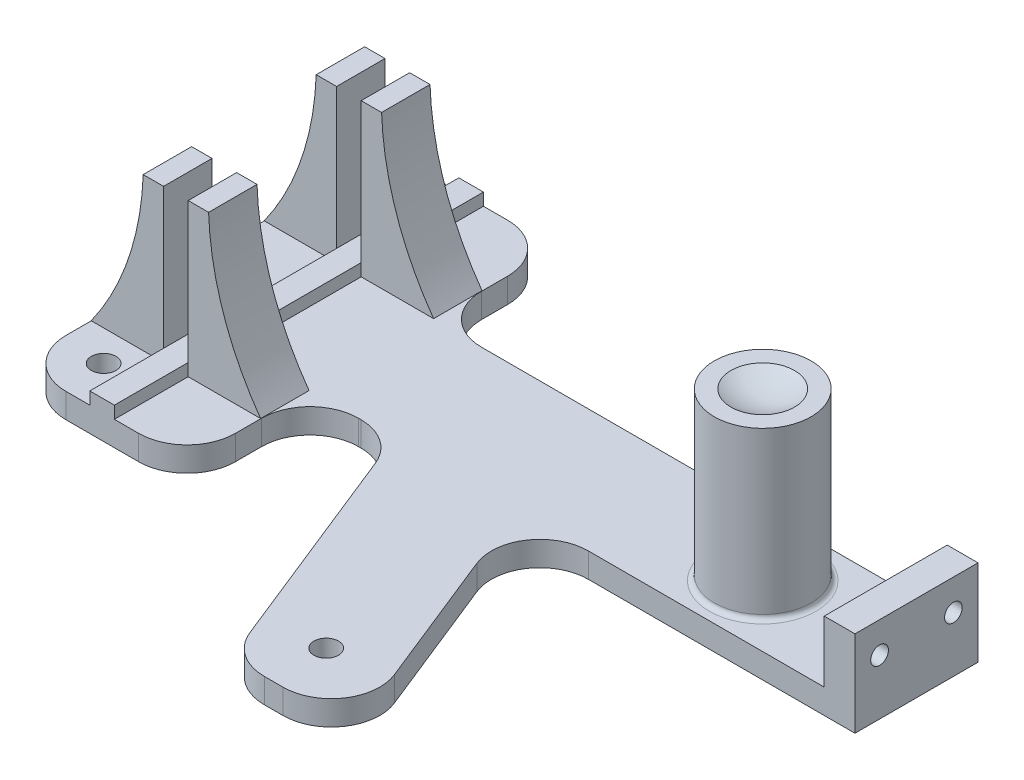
ISO-10303-21;
HEADER;
FILE_DESCRIPTION(('STEP AP214'),'2;1');
FILE_NAME('part.step','',(''),(''),'','','');
FILE_SCHEMA(('AUTOMOTIVE_DESIGN { 1 0 10303 214 1 1 1 1 }'));
ENDSEC;
DATA;
#1=APPLICATION_CONTEXT('core data for automotive mechanical design processes');
#2=APPLICATION_PROTOCOL_DEFINITION('international standard','automotive_design',2000,#1);
#3=PRODUCT_CONTEXT('',#1,'mechanical');
#4=PRODUCT('Part','Part','',(#3));
#5=PRODUCT_RELATED_PRODUCT_CATEGORY('part','',(#4));
#6=PRODUCT_DEFINITION_FORMATION('','',#4);
#7=PRODUCT_DEFINITION_CONTEXT('part definition',#1,'design');
#8=PRODUCT_DEFINITION('design','',#6,#7);
#9=PRODUCT_DEFINITION_SHAPE('','',#8);
#10=(LENGTH_UNIT() NAMED_UNIT(*) SI_UNIT(.MILLI.,.METRE.));
#11=(NAMED_UNIT(*) PLANE_ANGLE_UNIT() SI_UNIT($,.RADIAN.));
#12=(NAMED_UNIT(*) SI_UNIT($,.STERADIAN.) SOLID_ANGLE_UNIT());
#13=UNCERTAINTY_MEASURE_WITH_UNIT(LENGTH_MEASURE(1.E-05),#10,'distance_accuracy_value','');
#14=(GEOMETRIC_REPRESENTATION_CONTEXT(3) GLOBAL_UNCERTAINTY_ASSIGNED_CONTEXT((#13)) GLOBAL_UNIT_ASSIGNED_CONTEXT((#10,
#11,#12)) REPRESENTATION_CONTEXT('',''));
#15=CARTESIAN_POINT('',(0.,0.,0.));
#16=DIRECTION('',(0.,0.,1.));
#17=DIRECTION('',(1.,0.,0.));
#18=AXIS2_PLACEMENT_3D('',#15,#16,#17);
#19=CARTESIAN_POINT('',(30.08,0.,22.7));
#20=DIRECTION('',(0.,1.,0.));
#21=DIRECTION('',(0.,0.,1.));
#22=AXIS2_PLACEMENT_3D('',#19,#20,#21);
#23=PLANE('',#22);
#24=CARTESIAN_POINT('',(-6.03,0.,29.21));
#25=DIRECTION('',(0.,1.,0.));
#26=DIRECTION('',(0.,0.,1.));
#27=AXIS2_PLACEMENT_3D('',#24,#25,#26);
#28=CIRCLE('',#27,2.54);
#29=CARTESIAN_POINT('',(-6.03,0.,31.75));
#30=VERTEX_POINT('',#29);
#31=EDGE_CURVE('E408',#30,#30,#28,.F.);
#32=ORIENTED_EDGE('',*,*,#31,.T.);
#33=EDGE_LOOP('',(#32));
#34=FACE_BOUND('',#33,.T.);
#35=DIRECTION('',(1.,0.,0.));
#36=VECTOR('',#35,1.);
#37=CARTESIAN_POINT('',(-4.92,0.,38.1));
#38=LINE('',#37,#36);
#39=CARTESIAN_POINT('',(-4.92,0.,38.1));
#40=VERTEX_POINT('',#39);
#41=CARTESIAN_POINT('',(0.,0.,38.1));
#42=VERTEX_POINT('',#41);
#43=EDGE_CURVE('E56',#40,#42,#38,.T.);
#44=ORIENTED_EDGE('',*,*,#43,.T.);
#45=DIRECTION('',(0.,0.,1.));
#46=VECTOR('',#45,1.);
#47=CARTESIAN_POINT('',(0.,0.,-38.1));
#48=LINE('',#47,#46);
#49=CARTESIAN_POINT('',(0.,0.,22.86));
#50=VERTEX_POINT('',#49);
#51=EDGE_CURVE('E378',#50,#42,#48,.T.);
#52=ORIENTED_EDGE('',*,*,#51,.F.);
#53=DIRECTION('',(1.,0.,0.));
#54=VECTOR('',#53,1.);
#55=CARTESIAN_POINT('',(0.,0.,22.86));
#56=LINE('',#55,#54);
#57=CARTESIAN_POINT('',(-14.92,0.,22.86));
#58=VERTEX_POINT('',#57);
#59=EDGE_CURVE('E609',#58,#50,#56,.T.);
#60=ORIENTED_EDGE('',*,*,#59,.F.);
#61=DIRECTION('',(0.,0.,1.));
#62=VECTOR('',#61,1.);
#63=CARTESIAN_POINT('',(-14.92,0.,-28.1));
#64=LINE('',#63,#62);
#65=CARTESIAN_POINT('',(-14.92,0.,28.1));
#66=VERTEX_POINT('',#65);
#67=EDGE_CURVE('E675',#58,#66,#64,.T.);
#68=ORIENTED_EDGE('',*,*,#67,.T.);
#69=CARTESIAN_POINT('',(-4.92,0.,28.1));
#70=DIRECTION('',(0.,1.,0.));
#71=DIRECTION('',(0.,0.,1.));
#72=AXIS2_PLACEMENT_3D('',#69,#70,#71);
#73=CIRCLE('',#72,10.);
#74=EDGE_CURVE('E679',#66,#40,#73,.T.);
#75=ORIENTED_EDGE('',*,*,#74,.T.);
#76=EDGE_LOOP('',(#44,#52,#60,#68,#75));
#77=FACE_BOUND('',#76,.T.);
#78=ADVANCED_FACE('F33',(#34,#77),#23,.T.);
#79=DIRECTION('',(1.,0.,0.));
#80=VECTOR('',#79,1.);
#81=CARTESIAN_POINT('',(0.,0.,12.86));
#82=LINE('',#81,#80);
#83=CARTESIAN_POINT('',(-14.92,0.,12.86));
#84=VERTEX_POINT('',#83);
#85=CARTESIAN_POINT('',(0.,0.,12.86));
#86=VERTEX_POINT('',#85);
#87=EDGE_CURVE('E596',#84,#86,#82,.T.);
#88=ORIENTED_EDGE('',*,*,#87,.T.);
#89=CARTESIAN_POINT('',(0.,0.,-12.86));
#90=VERTEX_POINT('',#89);
#91=EDGE_CURVE('E1300',#90,#86,#48,.T.);
#92=ORIENTED_EDGE('',*,*,#91,.F.);
#93=DIRECTION('',(1.,0.,0.));
#94=VECTOR('',#93,1.);
#95=CARTESIAN_POINT('',(0.,0.,-12.86));
#96=LINE('',#95,#94);
#97=CARTESIAN_POINT('',(-14.92,0.,-12.86));
#98=VERTEX_POINT('',#97);
#99=EDGE_CURVE('E523',#98,#90,#96,.T.);
#100=ORIENTED_EDGE('',*,*,#99,.F.);
#101=EDGE_CURVE('E681',#98,#84,#64,.T.);
#102=ORIENTED_EDGE('',*,*,#101,.T.);
#103=EDGE_LOOP('',(#88,#92,#100,#102));
#104=FACE_BOUND('',#103,.T.);
#105=ADVANCED_FACE('F863',(#104),#23,.T.);
#106=CARTESIAN_POINT('',(-6.03,0.,-29.21));
#107=DIRECTION('',(0.,1.,0.));
#108=DIRECTION('',(0.,0.,1.));
#109=AXIS2_PLACEMENT_3D('',#106,#107,#108);
#110=CIRCLE('',#109,2.54);
#111=CARTESIAN_POINT('',(-6.03,0.,-26.67));
#112=VERTEX_POINT('',#111);
#113=EDGE_CURVE('E402',#112,#112,#110,.F.);
#114=ORIENTED_EDGE('',*,*,#113,.T.);
#115=EDGE_LOOP('',(#114));
#116=FACE_BOUND('',#115,.T.);
#117=DIRECTION('',(1.,0.,0.));
#118=VECTOR('',#117,1.);
#119=CARTESIAN_POINT('',(0.,0.,-22.86));
#120=LINE('',#119,#118);
#121=CARTESIAN_POINT('',(-14.92,0.,-22.86));
#122=VERTEX_POINT('',#121);
#123=CARTESIAN_POINT('',(0.,0.,-22.86));
#124=VERTEX_POINT('',#123);
#125=EDGE_CURVE('E536',#122,#124,#120,.T.);
#126=ORIENTED_EDGE('',*,*,#125,.T.);
#127=CARTESIAN_POINT('',(0.,0.,-38.1));
#128=VERTEX_POINT('',#127);
#129=EDGE_CURVE('E1297',#128,#124,#48,.T.);
#130=ORIENTED_EDGE('',*,*,#129,.F.);
#131=DIRECTION('',(-1.,0.,0.));
#132=VECTOR('',#131,1.);
#133=CARTESIAN_POINT('',(-4.92,0.,-38.1));
#134=LINE('',#133,#132);
#135=CARTESIAN_POINT('',(-4.91999999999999,0.,-38.1));
#136=VERTEX_POINT('',#135);
#137=EDGE_CURVE('E669',#128,#136,#134,.T.);
#138=ORIENTED_EDGE('',*,*,#137,.T.);
#139=CARTESIAN_POINT('',(-4.92,0.,-28.1));
#140=DIRECTION('',(0.,1.,0.));
#141=DIRECTION('',(0.,0.,1.));
#142=AXIS2_PLACEMENT_3D('',#139,#140,#141);
#143=CIRCLE('',#142,10.);
#144=CARTESIAN_POINT('',(-14.92,0.,-28.1));
#145=VERTEX_POINT('',#144);
#146=EDGE_CURVE('E672',#136,#145,#143,.T.);
#147=ORIENTED_EDGE('',*,*,#146,.T.);
#148=EDGE_CURVE('E676',#145,#122,#64,.T.);
#149=ORIENTED_EDGE('',*,*,#148,.T.);
#150=EDGE_LOOP('',(#126,#130,#138,#147,#149));
#151=FACE_BOUND('',#150,.T.);
#152=ADVANCED_FACE('F869',(#116,#151),#23,.T.);
#153=CARTESIAN_POINT('',(100.84,0.,0.));
#154=DIRECTION('',(0.,1.,0.));
#155=DIRECTION('',(0.,0.,1.));
#156=AXIS2_PLACEMENT_3D('',#153,#154,#155);
#157=CIRCLE('',#156,11.);
#158=CARTESIAN_POINT('',(100.84,0.,11.));
#159=VERTEX_POINT('',#158);
#160=EDGE_CURVE('E733',#159,#159,#157,.F.);
#161=ORIENTED_EDGE('',*,*,#160,.T.);
#162=EDGE_LOOP('',(#161));
#163=FACE_BOUND('',#162,.T.);
#164=CARTESIAN_POINT('',(67.8645239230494,0.,57.15));
#165=DIRECTION('',(0.,1.,0.));
#166=DIRECTION('',(0.,0.,1.));
#167=AXIS2_PLACEMENT_3D('',#164,#165,#166);
#168=CIRCLE('',#167,2.54);
#169=CARTESIAN_POINT('',(67.8645239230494,0.,59.69));
#170=VERTEX_POINT('',#169);
#171=EDGE_CURVE('E396',#170,#170,#168,.F.);
#172=ORIENTED_EDGE('',*,*,#171,.T.);
#173=EDGE_LOOP('',(#172));
#174=FACE_BOUND('',#173,.T.);
#175=CARTESIAN_POINT('',(118.62,0.,0.));
#176=DIRECTION('',(0.,1.,0.));
#177=DIRECTION('',(0.,0.,1.));
#178=AXIS2_PLACEMENT_3D('',#175,#176,#177);
#179=CIRCLE('',#178,2.54);
#180=CARTESIAN_POINT('',(118.62,0.,2.54));
#181=VERTEX_POINT('',#180);
#182=EDGE_CURVE('E392',#181,#181,#179,.F.);
#183=ORIENTED_EDGE('',*,*,#182,.T.);
#184=EDGE_LOOP('',(#183));
#185=FACE_BOUND('',#184,.T.);
#186=CARTESIAN_POINT('',(10.08,0.,-38.1));
#187=VERTEX_POINT('',#186);
#188=CARTESIAN_POINT('',(5.08000000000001,0.,-38.1));
#189=VERTEX_POINT('',#188);
#190=EDGE_CURVE('E670',#187,#189,#134,.T.);
#191=ORIENTED_EDGE('',*,*,#190,.T.);
#192=DIRECTION('',(0.,0.,-1.));
#193=VECTOR('',#192,1.);
#194=CARTESIAN_POINT('',(5.08,0.,-38.1));
#195=LINE('',#194,#193);
#196=CARTESIAN_POINT('',(5.08,0.,-22.86));
#197=VERTEX_POINT('',#196);
#198=EDGE_CURVE('E1270',#197,#189,#195,.T.);
#199=ORIENTED_EDGE('',*,*,#198,.F.);
#200=DIRECTION('',(1.,0.,0.));
#201=VECTOR('',#200,1.);
#202=CARTESIAN_POINT('',(5.08,0.,-22.86));
#203=LINE('',#202,#201);
#204=CARTESIAN_POINT('',(20.033299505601,0.,-22.86));
#205=VERTEX_POINT('',#204);
#206=EDGE_CURVE('E495',#197,#205,#203,.T.);
#207=ORIENTED_EDGE('',*,*,#206,.T.);
#208=DIRECTION('',(0.,0.,-1.));
#209=VECTOR('',#208,1.);
#210=CARTESIAN_POINT('',(20.033299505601,0.,-12.86));
#211=LINE('',#210,#209);
#212=CARTESIAN_POINT('',(20.033299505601,0.,-12.86));
#213=VERTEX_POINT('',#212);
#214=EDGE_CURVE('E511',#213,#205,#211,.T.);
#215=ORIENTED_EDGE('',*,*,#214,.F.);
#216=DIRECTION('',(1.,0.,0.));
#217=VECTOR('',#216,1.);
#218=CARTESIAN_POINT('',(5.08,0.,-12.86));
#219=LINE('',#218,#217);
#220=CARTESIAN_POINT('',(5.08,0.,-12.86));
#221=VERTEX_POINT('',#220);
#222=EDGE_CURVE('E499',#221,#213,#219,.T.);
#223=ORIENTED_EDGE('',*,*,#222,.F.);
#224=CARTESIAN_POINT('',(5.08,0.,12.86));
#225=VERTEX_POINT('',#224);
#226=EDGE_CURVE('E1289',#225,#221,#195,.T.);
#227=ORIENTED_EDGE('',*,*,#226,.F.);
#228=DIRECTION('',(1.,0.,0.));
#229=VECTOR('',#228,1.);
#230=CARTESIAN_POINT('',(5.08,0.,12.86));
#231=LINE('',#230,#229);
#232=CARTESIAN_POINT('',(20.033299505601,0.,12.86));
#233=VERTEX_POINT('',#232);
#234=EDGE_CURVE('E556',#225,#233,#231,.T.);
#235=ORIENTED_EDGE('',*,*,#234,.T.);
#236=DIRECTION('',(0.,0.,1.));
#237=VECTOR('',#236,1.);
#238=CARTESIAN_POINT('',(20.033299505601,0.,12.86));
#239=LINE('',#238,#237);
#240=CARTESIAN_POINT('',(20.033299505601,0.,22.86));
#241=VERTEX_POINT('',#240);
#242=EDGE_CURVE('E565',#233,#241,#239,.T.);
#243=ORIENTED_EDGE('',*,*,#242,.T.);
#244=DIRECTION('',(1.,0.,0.));
#245=VECTOR('',#244,1.);
#246=CARTESIAN_POINT('',(5.08,0.,22.86));
#247=LINE('',#246,#245);
#248=CARTESIAN_POINT('',(5.08,0.,22.86));
#249=VERTEX_POINT('',#248);
#250=EDGE_CURVE('E568',#249,#241,#247,.T.);
#251=ORIENTED_EDGE('',*,*,#250,.F.);
#252=CARTESIAN_POINT('',(5.08000000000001,0.,38.1));
#253=VERTEX_POINT('',#252);
#254=EDGE_CURVE('E48',#253,#249,#195,.T.);
#255=ORIENTED_EDGE('',*,*,#254,.F.);
#256=CARTESIAN_POINT('',(10.08,0.,38.1));
#257=VERTEX_POINT('',#256);
#258=EDGE_CURVE('E684',#253,#257,#38,.T.);
#259=ORIENTED_EDGE('',*,*,#258,.T.);
#260=CARTESIAN_POINT('',(10.08,0.,28.1));
#261=DIRECTION('',(0.,1.,0.));
#262=DIRECTION('',(0.,0.,-1.));
#263=AXIS2_PLACEMENT_3D('',#260,#261,#262);
#264=CIRCLE('',#263,10.);
#265=CARTESIAN_POINT('',(20.08,0.,28.1));
#266=VERTEX_POINT('',#265);
#267=EDGE_CURVE('E686',#257,#266,#264,.T.);
#268=ORIENTED_EDGE('',*,*,#267,.T.);
#269=DIRECTION('',(0.,0.,-1.));
#270=VECTOR('',#269,1.);
#271=CARTESIAN_POINT('',(20.08,0.,28.1));
#272=LINE('',#271,#270);
#273=CARTESIAN_POINT('',(20.08,0.,22.7));
#274=VERTEX_POINT('',#273);
#275=EDGE_CURVE('E689',#266,#274,#272,.T.);
#276=ORIENTED_EDGE('',*,*,#275,.T.);
#277=CARTESIAN_POINT('',(30.08,0.,22.7));
#278=DIRECTION('',(0.,-1.,0.));
#279=DIRECTION('',(0.,0.,1.));
#280=AXIS2_PLACEMENT_3D('',#277,#278,#279);
#281=CIRCLE('',#280,10.);
#282=CARTESIAN_POINT('',(30.08,0.,12.7));
#283=VERTEX_POINT('',#282);
#284=EDGE_CURVE('E692',#274,#283,#281,.T.);
#285=ORIENTED_EDGE('',*,*,#284,.T.);
#286=DIRECTION('',(1.,0.,0.));
#287=VECTOR('',#286,1.);
#288=CARTESIAN_POINT('',(30.08,0.,12.7));
#289=LINE('',#288,#287);
#290=CARTESIAN_POINT('',(30.5759629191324,0.,12.7));
#291=VERTEX_POINT('',#290);
#292=EDGE_CURVE('E696',#283,#291,#289,.T.);
#293=ORIENTED_EDGE('',*,*,#292,.T.);
#294=CARTESIAN_POINT('',(30.5759629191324,0.,22.7));
#295=DIRECTION('',(0.,1.,0.));
#296=DIRECTION('',(0.,0.,1.));
#297=AXIS2_PLACEMENT_3D('',#294,#295,#296);
#298=CIRCLE('',#297,10.);
#299=CARTESIAN_POINT('',(39.8575205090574,0.,18.9780799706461));
#300=VERTEX_POINT('',#299);
#301=EDGE_CURVE('E41',#291,#300,#298,.F.);
#302=ORIENTED_EDGE('',*,*,#301,.T.);
#303=DIRECTION('',(0.372192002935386,0.,0.928155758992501));
#304=VECTOR('',#303,1.);
#305=CARTESIAN_POINT('',(37.34,0.,12.7));
#306=LINE('',#305,#304);
#307=CARTESIAN_POINT('',(57.2304524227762,0.,62.3019200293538));
#308=VERTEX_POINT('',#307);
#309=EDGE_CURVE('E414',#300,#308,#306,.T.);
#310=ORIENTED_EDGE('',*,*,#309,.T.);
#311=CARTESIAN_POINT('',(66.5120100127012,0.,58.58));
#312=DIRECTION('',(0.,1.,0.));
#313=DIRECTION('',(0.,0.,1.));
#314=AXIS2_PLACEMENT_3D('',#311,#312,#313);
#315=CIRCLE('',#314,10.);
#316=CARTESIAN_POINT('',(66.5120100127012,0.,68.58));
#317=VERTEX_POINT('',#316);
#318=EDGE_CURVE('E434',#308,#317,#315,.T.);
#319=ORIENTED_EDGE('',*,*,#318,.T.);
#320=DIRECTION('',(1.,0.,0.));
#321=VECTOR('',#320,1.);
#322=CARTESIAN_POINT('',(70.3639025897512,0.,68.58));
#323=LINE('',#322,#321);
#324=CARTESIAN_POINT('',(70.3639025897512,0.,68.58));
#325=VERTEX_POINT('',#324);
#326=EDGE_CURVE('E437',#317,#325,#323,.T.);
#327=ORIENTED_EDGE('',*,*,#326,.T.);
#328=CARTESIAN_POINT('',(70.3639025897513,0.,58.58));
#329=DIRECTION('',(0.,1.,0.));
#330=DIRECTION('',(0.,0.,-1.));
#331=AXIS2_PLACEMENT_3D('',#328,#329,#330);
#332=CIRCLE('',#331,10.);
#333=CARTESIAN_POINT('',(79.6454601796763,0.,54.858079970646));
#334=VERTEX_POINT('',#333);
#335=EDGE_CURVE('E440',#325,#334,#332,.T.);
#336=ORIENTED_EDGE('',*,*,#335,.T.);
#337=DIRECTION('',(-0.372192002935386,0.,-0.928155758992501));
#338=VECTOR('',#337,1.);
#339=CARTESIAN_POINT('',(62.74,0.,12.7));
#340=LINE('',#339,#338);
#341=CARTESIAN_POINT('',(68.2425127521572,0.,26.4219200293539));
#342=VERTEX_POINT('',#341);
#343=EDGE_CURVE('E420',#334,#342,#340,.T.);
#344=ORIENTED_EDGE('',*,*,#343,.T.);
#345=CARTESIAN_POINT('',(77.5240703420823,0.,22.7));
#346=DIRECTION('',(0.,1.,0.));
#347=DIRECTION('',(0.,0.,1.));
#348=AXIS2_PLACEMENT_3D('',#345,#346,#347);
#349=CIRCLE('',#348,10.);
#350=CARTESIAN_POINT('',(77.5240703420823,0.,12.7));
#351=VERTEX_POINT('',#350);
#352=EDGE_CURVE('E741',#342,#351,#349,.F.);
#353=ORIENTED_EDGE('',*,*,#352,.T.);
#354=CARTESIAN_POINT('',(126.24,0.,12.7));
#355=VERTEX_POINT('',#354);
#356=EDGE_CURVE('E695',#351,#355,#289,.T.);
#357=ORIENTED_EDGE('',*,*,#356,.T.);
#358=DIRECTION('',(0.,0.,1.));
#359=VECTOR('',#358,1.);
#360=CARTESIAN_POINT('',(126.24,0.,12.7));
#361=LINE('',#360,#359);
#362=CARTESIAN_POINT('',(126.24,0.,-12.7));
#363=VERTEX_POINT('',#362);
#364=EDGE_CURVE('E465',#363,#355,#361,.T.);
#365=ORIENTED_EDGE('',*,*,#364,.F.);
#366=DIRECTION('',(-1.,0.,0.));
#367=VECTOR('',#366,1.);
#368=CARTESIAN_POINT('',(30.08,0.,-12.7));
#369=LINE('',#368,#367);
#370=CARTESIAN_POINT('',(30.08,0.,-12.7));
#371=VERTEX_POINT('',#370);
#372=EDGE_CURVE('E612',#363,#371,#369,.T.);
#373=ORIENTED_EDGE('',*,*,#372,.T.);
#374=CARTESIAN_POINT('',(30.08,0.,-22.7));
#375=DIRECTION('',(0.,-1.,0.));
#376=DIRECTION('',(0.,0.,1.));
#377=AXIS2_PLACEMENT_3D('',#374,#375,#376);
#378=CIRCLE('',#377,10.);
#379=CARTESIAN_POINT('',(20.08,0.,-22.7));
#380=VERTEX_POINT('',#379);
#381=EDGE_CURVE('E660',#371,#380,#378,.T.);
#382=ORIENTED_EDGE('',*,*,#381,.T.);
#383=DIRECTION('',(0.,0.,-1.));
#384=VECTOR('',#383,1.);
#385=CARTESIAN_POINT('',(20.08,0.,-28.1));
#386=LINE('',#385,#384);
#387=CARTESIAN_POINT('',(20.08,0.,-28.1));
#388=VERTEX_POINT('',#387);
#389=EDGE_CURVE('E663',#380,#388,#386,.T.);
#390=ORIENTED_EDGE('',*,*,#389,.T.);
#391=CARTESIAN_POINT('',(10.08,0.,-28.1));
#392=DIRECTION('',(0.,1.,0.));
#393=DIRECTION('',(0.,0.,1.));
#394=AXIS2_PLACEMENT_3D('',#391,#392,#393);
#395=CIRCLE('',#394,10.);
#396=EDGE_CURVE('E666',#388,#187,#395,.T.);
#397=ORIENTED_EDGE('',*,*,#396,.T.);
#398=EDGE_LOOP('',(#191,#199,#207,#215,#223,#227,#235,#243,#251,#255,#259,#268,#276,#285,#293,
#302,#310,#319,#327,#336,#344,#353,#357,#365,#373,#382,#390,#397));
#399=FACE_BOUND('',#398,.T.);
#400=ADVANCED_FACE('F750',(#163,#174,#185,#399),#23,.T.);
#401=CARTESIAN_POINT('',(30.08,-5.08,12.7));
#402=DIRECTION('',(0.,0.,1.));
#403=DIRECTION('',(1.,0.,0.));
#404=AXIS2_PLACEMENT_3D('',#401,#402,#403);
#405=PLANE('',#404);
#406=ORIENTED_EDGE('',*,*,#356,.F.);
#407=DIRECTION('',(0.,1.,0.));
#408=VECTOR('',#407,1.);
#409=CARTESIAN_POINT('',(77.5240703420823,-5.08,12.7));
#410=LINE('',#409,#408);
#411=CARTESIAN_POINT('',(77.5240703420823,-5.08,12.7));
#412=VERTEX_POINT('',#411);
#413=EDGE_CURVE('E739',#351,#412,#410,.F.);
#414=ORIENTED_EDGE('',*,*,#413,.T.);
#415=DIRECTION('',(1.,0.,0.));
#416=VECTOR('',#415,1.);
#417=CARTESIAN_POINT('',(132.59,-5.08,12.7));
#418=LINE('',#417,#416);
#419=CARTESIAN_POINT('',(132.59,-5.08,12.7));
#420=VERTEX_POINT('',#419);
#421=EDGE_CURVE('E621',#412,#420,#418,.T.);
#422=ORIENTED_EDGE('',*,*,#421,.T.);
#423=DIRECTION('',(0.,1.,0.));
#424=VECTOR('',#423,1.);
#425=CARTESIAN_POINT('',(132.59,-5.08,12.7));
#426=LINE('',#425,#424);
#427=CARTESIAN_POINT('',(132.59,12.7,12.7));
#428=VERTEX_POINT('',#427);
#429=EDGE_CURVE('E658',#420,#428,#426,.T.);
#430=ORIENTED_EDGE('',*,*,#429,.T.);
#431=DIRECTION('',(1.,0.,0.));
#432=VECTOR('',#431,1.);
#433=CARTESIAN_POINT('',(132.59,12.7,12.7));
#434=LINE('',#433,#432);
#435=CARTESIAN_POINT('',(126.24,12.7,12.7));
#436=VERTEX_POINT('',#435);
#437=EDGE_CURVE('E473',#436,#428,#434,.T.);
#438=ORIENTED_EDGE('',*,*,#437,.F.);
#439=DIRECTION('',(0.,-1.,0.));
#440=VECTOR('',#439,1.);
#441=CARTESIAN_POINT('',(126.24,12.7,12.7));
#442=LINE('',#441,#440);
#443=EDGE_CURVE('E476',#436,#355,#442,.T.);
#444=ORIENTED_EDGE('',*,*,#443,.T.);
#445=EDGE_LOOP('',(#406,#414,#422,#430,#438,#444));
#446=FACE_BOUND('',#445,.T.);
#447=ADVANCED_FACE('F828',(#446),#405,.T.);
#448=CARTESIAN_POINT('',(30.08,-5.08,12.7));
#449=VERTEX_POINT('',#448);
#450=CARTESIAN_POINT('',(30.5759629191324,-5.08,12.7));
#451=VERTEX_POINT('',#450);
#452=EDGE_CURVE('E617',#449,#451,#418,.T.);
#453=ORIENTED_EDGE('',*,*,#452,.T.);
#454=DIRECTION('',(0.,1.,0.));
#455=VECTOR('',#454,1.);
#456=CARTESIAN_POINT('',(30.5759629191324,0.,12.7));
#457=LINE('',#456,#455);
#458=EDGE_CURVE('E745',#451,#291,#457,.T.);
#459=ORIENTED_EDGE('',*,*,#458,.T.);
#460=ORIENTED_EDGE('',*,*,#292,.F.);
#461=DIRECTION('',(0.,1.,0.));
#462=VECTOR('',#461,1.);
#463=CARTESIAN_POINT('',(30.08,-5.08,12.7));
#464=LINE('',#463,#462);
#465=EDGE_CURVE('E699',#449,#283,#464,.T.);
#466=ORIENTED_EDGE('',*,*,#465,.F.);
#467=EDGE_LOOP('',(#453,#459,#460,#466));
#468=FACE_BOUND('',#467,.T.);
#469=ADVANCED_FACE('F767',(#468),#405,.T.);
#470=CARTESIAN_POINT('',(30.08,-5.08,22.7));
#471=DIRECTION('',(0.,1.,0.));
#472=DIRECTION('',(0.,0.,1.));
#473=AXIS2_PLACEMENT_3D('',#470,#471,#472);
#474=CYLINDRICAL_SURFACE('',#473,10.);
#475=ORIENTED_EDGE('',*,*,#284,.F.);
#476=DIRECTION('',(0.,1.,0.));
#477=VECTOR('',#476,1.);
#478=CARTESIAN_POINT('',(20.08,-5.08,22.7));
#479=LINE('',#478,#477);
#480=CARTESIAN_POINT('',(20.08,-5.08,22.7));
#481=VERTEX_POINT('',#480);
#482=EDGE_CURVE('E701',#481,#274,#479,.T.);
#483=ORIENTED_EDGE('',*,*,#482,.F.);
#484=CARTESIAN_POINT('',(30.08,-5.08,22.7));
#485=DIRECTION('',(0.,-1.,0.));
#486=DIRECTION('',(0.,0.,1.));
#487=AXIS2_PLACEMENT_3D('',#484,#485,#486);
#488=CIRCLE('',#487,10.);
#489=EDGE_CURVE('E655',#481,#449,#488,.T.);
#490=ORIENTED_EDGE('',*,*,#489,.T.);
#491=ORIENTED_EDGE('',*,*,#465,.T.);
#492=EDGE_LOOP('',(#475,#483,#490,#491));
#493=FACE_BOUND('',#492,.T.);
#494=ADVANCED_FACE('F770',(#493),#474,.F.);
#495=CARTESIAN_POINT('',(20.08,-5.08,28.1));
#496=DIRECTION('',(1.,0.,0.));
#497=DIRECTION('',(0.,0.,-1.));
#498=AXIS2_PLACEMENT_3D('',#495,#496,#497);
#499=PLANE('',#498);
#500=ORIENTED_EDGE('',*,*,#275,.F.);
#501=DIRECTION('',(0.,1.,0.));
#502=VECTOR('',#501,1.);
#503=CARTESIAN_POINT('',(20.08,-5.08,28.1));
#504=LINE('',#503,#502);
#505=CARTESIAN_POINT('',(20.08,-5.08,28.1));
#506=VERTEX_POINT('',#505);
#507=EDGE_CURVE('E703',#506,#266,#504,.T.);
#508=ORIENTED_EDGE('',*,*,#507,.F.);
#509=DIRECTION('',(0.,0.,-1.));
#510=VECTOR('',#509,1.);
#511=CARTESIAN_POINT('',(20.08,-5.08,28.1));
#512=LINE('',#511,#510);
#513=EDGE_CURVE('E652',#506,#481,#512,.T.);
#514=ORIENTED_EDGE('',*,*,#513,.T.);
#515=ORIENTED_EDGE('',*,*,#482,.T.);
#516=EDGE_LOOP('',(#500,#508,#514,#515));
#517=FACE_BOUND('',#516,.T.);
#518=ADVANCED_FACE('F775',(#517),#499,.T.);
#519=CARTESIAN_POINT('',(10.08,-5.08,28.1));
#520=DIRECTION('',(0.,1.,0.));
#521=DIRECTION('',(0.,0.,1.));
#522=AXIS2_PLACEMENT_3D('',#519,#520,#521);
#523=CYLINDRICAL_SURFACE('',#522,10.);
#524=ORIENTED_EDGE('',*,*,#267,.F.);
#525=DIRECTION('',(0.,1.,0.));
#526=VECTOR('',#525,1.);
#527=CARTESIAN_POINT('',(10.08,-5.08,38.1));
#528=LINE('',#527,#526);
#529=CARTESIAN_POINT('',(10.08,-5.08,38.1));
#530=VERTEX_POINT('',#529);
#531=EDGE_CURVE('E705',#530,#257,#528,.T.);
#532=ORIENTED_EDGE('',*,*,#531,.F.);
#533=CARTESIAN_POINT('',(10.08,-5.08,28.1));
#534=DIRECTION('',(0.,1.,0.));
#535=DIRECTION('',(0.,0.,-1.));
#536=AXIS2_PLACEMENT_3D('',#533,#534,#535);
#537=CIRCLE('',#536,10.);
#538=EDGE_CURVE('E649',#530,#506,#537,.T.);
#539=ORIENTED_EDGE('',*,*,#538,.T.);
#540=ORIENTED_EDGE('',*,*,#507,.T.);
#541=EDGE_LOOP('',(#524,#532,#539,#540));
#542=FACE_BOUND('',#541,.T.);
#543=ADVANCED_FACE('F778',(#542),#523,.T.);
#544=CARTESIAN_POINT('',(-4.92,-5.08,38.1));
#545=DIRECTION('',(0.,0.,1.));
#546=DIRECTION('',(1.,0.,0.));
#547=AXIS2_PLACEMENT_3D('',#544,#545,#546);
#548=PLANE('',#547);
#549=ORIENTED_EDGE('',*,*,#43,.F.);
#550=DIRECTION('',(0.,1.,0.));
#551=VECTOR('',#550,1.);
#552=CARTESIAN_POINT('',(-4.92,-5.08,38.1));
#553=LINE('',#552,#551);
#554=CARTESIAN_POINT('',(-4.92,-5.08,38.1));
#555=VERTEX_POINT('',#554);
#556=EDGE_CURVE('E708',#555,#40,#553,.T.);
#557=ORIENTED_EDGE('',*,*,#556,.F.);
#558=DIRECTION('',(1.,0.,0.));
#559=VECTOR('',#558,1.);
#560=CARTESIAN_POINT('',(-4.92,-5.08,38.1));
#561=LINE('',#560,#559);
#562=EDGE_CURVE('E646',#555,#530,#561,.T.);
#563=ORIENTED_EDGE('',*,*,#562,.T.);
#564=ORIENTED_EDGE('',*,*,#531,.T.);
#565=ORIENTED_EDGE('',*,*,#258,.F.);
#566=DIRECTION('',(0.,-1.,0.));
#567=VECTOR('',#566,1.);
#568=CARTESIAN_POINT('',(5.08000000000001,2.54,38.1));
#569=LINE('',#568,#567);
#570=CARTESIAN_POINT('',(5.08000000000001,2.54,38.1));
#571=VERTEX_POINT('',#570);
#572=EDGE_CURVE('E373',#571,#253,#569,.T.);
#573=ORIENTED_EDGE('',*,*,#572,.F.);
#574=DIRECTION('',(1.,0.,0.));
#575=VECTOR('',#574,1.);
#576=CARTESIAN_POINT('',(0.,2.54,38.1));
#577=LINE('',#576,#575);
#578=CARTESIAN_POINT('',(0.,2.54,38.1));
#579=VERTEX_POINT('',#578);
#580=EDGE_CURVE('E359',#579,#571,#577,.T.);
#581=ORIENTED_EDGE('',*,*,#580,.F.);
#582=DIRECTION('',(0.,-1.,0.));
#583=VECTOR('',#582,1.);
#584=CARTESIAN_POINT('',(0.,2.54,38.1));
#585=LINE('',#584,#583);
#586=EDGE_CURVE('E371',#579,#42,#585,.T.);
#587=ORIENTED_EDGE('',*,*,#586,.T.);
#588=EDGE_LOOP('',(#549,#557,#563,#564,#565,#573,#581,#587));
#589=FACE_BOUND('',#588,.T.);
#590=ADVANCED_FACE('F370',(#589),#548,.T.);
#591=CARTESIAN_POINT('',(-4.92,-5.08,28.1));
#592=DIRECTION('',(0.,1.,0.));
#593=DIRECTION('',(0.,0.,1.));
#594=AXIS2_PLACEMENT_3D('',#591,#592,#593);
#595=CYLINDRICAL_SURFACE('',#594,10.);
#596=ORIENTED_EDGE('',*,*,#74,.F.);
#597=DIRECTION('',(0.,1.,0.));
#598=VECTOR('',#597,1.);
#599=CARTESIAN_POINT('',(-14.92,-5.08,28.1));
#600=LINE('',#599,#598);
#601=CARTESIAN_POINT('',(-14.92,-5.08,28.1));
#602=VERTEX_POINT('',#601);
#603=EDGE_CURVE('E710',#602,#66,#600,.T.);
#604=ORIENTED_EDGE('',*,*,#603,.F.);
#605=CARTESIAN_POINT('',(-4.92,-5.08,28.1));
#606=DIRECTION('',(0.,1.,0.));
#607=DIRECTION('',(0.,0.,1.));
#608=AXIS2_PLACEMENT_3D('',#605,#606,#607);
#609=CIRCLE('',#608,10.);
#610=EDGE_CURVE('E643',#602,#555,#609,.T.);
#611=ORIENTED_EDGE('',*,*,#610,.T.);
#612=ORIENTED_EDGE('',*,*,#556,.T.);
#613=EDGE_LOOP('',(#596,#604,#611,#612));
#614=FACE_BOUND('',#613,.T.);
#615=ADVANCED_FACE('F783',(#614),#595,.T.);
#616=CARTESIAN_POINT('',(-14.92,-5.08,-28.1));
#617=DIRECTION('',(-1.,0.,0.));
#618=DIRECTION('',(0.,0.,1.));
#619=AXIS2_PLACEMENT_3D('',#616,#617,#618);
#620=PLANE('',#619);
#621=ORIENTED_EDGE('',*,*,#148,.F.);
#622=DIRECTION('',(0.,1.,0.));
#623=VECTOR('',#622,1.);
#624=CARTESIAN_POINT('',(-14.92,-5.08,-28.1));
#625=LINE('',#624,#623);
#626=CARTESIAN_POINT('',(-14.92,-5.08,-28.1));
#627=VERTEX_POINT('',#626);
#628=EDGE_CURVE('E713',#627,#145,#625,.T.);
#629=ORIENTED_EDGE('',*,*,#628,.F.);
#630=DIRECTION('',(0.,0.,1.));
#631=VECTOR('',#630,1.);
#632=CARTESIAN_POINT('',(-14.92,-5.08,-28.1));
#633=LINE('',#632,#631);
#634=EDGE_CURVE('E640',#627,#602,#633,.T.);
#635=ORIENTED_EDGE('',*,*,#634,.T.);
#636=ORIENTED_EDGE('',*,*,#603,.T.);
#637=ORIENTED_EDGE('',*,*,#67,.F.);
#638=EDGE_CURVE('E682',#84,#58,#64,.T.);
#639=ORIENTED_EDGE('',*,*,#638,.F.);
#640=ORIENTED_EDGE('',*,*,#101,.F.);
#641=EDGE_CURVE('E680',#122,#98,#64,.T.);
#642=ORIENTED_EDGE('',*,*,#641,.F.);
#643=EDGE_LOOP('',(#621,#629,#635,#636,#637,#639,#640,#642));
#644=FACE_BOUND('',#643,.T.);
#645=ADVANCED_FACE('F788',(#644),#620,.T.);
#646=CARTESIAN_POINT('',(-4.92,-5.08,-28.1));
#647=DIRECTION('',(0.,1.,0.));
#648=DIRECTION('',(0.,0.,1.));
#649=AXIS2_PLACEMENT_3D('',#646,#647,#648);
#650=CYLINDRICAL_SURFACE('',#649,10.);
#651=ORIENTED_EDGE('',*,*,#146,.F.);
#652=DIRECTION('',(0.,1.,0.));
#653=VECTOR('',#652,1.);
#654=CARTESIAN_POINT('',(-4.91999999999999,-5.08,-38.1));
#655=LINE('',#654,#653);
#656=CARTESIAN_POINT('',(-4.91999999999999,-5.08,-38.1));
#657=VERTEX_POINT('',#656);
#658=EDGE_CURVE('E715',#657,#136,#655,.T.);
#659=ORIENTED_EDGE('',*,*,#658,.F.);
#660=CARTESIAN_POINT('',(-4.92,-5.08,-28.1));
#661=DIRECTION('',(0.,1.,0.));
#662=DIRECTION('',(0.,0.,1.));
#663=AXIS2_PLACEMENT_3D('',#660,#661,#662);
#664=CIRCLE('',#663,10.);
#665=EDGE_CURVE('E637',#657,#627,#664,.T.);
#666=ORIENTED_EDGE('',*,*,#665,.T.);
#667=ORIENTED_EDGE('',*,*,#628,.T.);
#668=EDGE_LOOP('',(#651,#659,#666,#667));
#669=FACE_BOUND('',#668,.T.);
#670=ADVANCED_FACE('F792',(#669),#650,.T.);
#671=CARTESIAN_POINT('',(-4.92,-5.08,-38.1));
#672=DIRECTION('',(0.,0.,-1.));
#673=DIRECTION('',(-1.,0.,0.));
#674=AXIS2_PLACEMENT_3D('',#671,#672,#673);
#675=PLANE('',#674);
#676=ORIENTED_EDGE('',*,*,#190,.F.);
#677=DIRECTION('',(0.,1.,0.));
#678=VECTOR('',#677,1.);
#679=CARTESIAN_POINT('',(10.08,-5.08,-38.1));
#680=LINE('',#679,#678);
#681=CARTESIAN_POINT('',(10.08,-5.08,-38.1));
#682=VERTEX_POINT('',#681);
#683=EDGE_CURVE('E718',#682,#187,#680,.T.);
#684=ORIENTED_EDGE('',*,*,#683,.F.);
#685=DIRECTION('',(-1.,0.,0.));
#686=VECTOR('',#685,1.);
#687=CARTESIAN_POINT('',(-4.92,-5.08,-38.1));
#688=LINE('',#687,#686);
#689=EDGE_CURVE('E634',#682,#657,#688,.T.);
#690=ORIENTED_EDGE('',*,*,#689,.T.);
#691=ORIENTED_EDGE('',*,*,#658,.T.);
#692=ORIENTED_EDGE('',*,*,#137,.F.);
#693=DIRECTION('',(0.,-1.,0.));
#694=VECTOR('',#693,1.);
#695=CARTESIAN_POINT('',(0.,2.54,-38.1));
#696=LINE('',#695,#694);
#697=CARTESIAN_POINT('',(0.,2.54,-38.1));
#698=VERTEX_POINT('',#697);
#699=EDGE_CURVE('E1296',#698,#128,#696,.T.);
#700=ORIENTED_EDGE('',*,*,#699,.F.);
#701=DIRECTION('',(-1.,0.,0.));
#702=VECTOR('',#701,1.);
#703=CARTESIAN_POINT('',(0.,2.54,-38.1));
#704=LINE('',#703,#702);
#705=CARTESIAN_POINT('',(5.08,2.54,-38.1));
#706=VERTEX_POINT('',#705);
#707=EDGE_CURVE('E1294',#706,#698,#704,.T.);
#708=ORIENTED_EDGE('',*,*,#707,.F.);
#709=DIRECTION('',(0.,-1.,0.));
#710=VECTOR('',#709,1.);
#711=CARTESIAN_POINT('',(5.08,2.54,-38.1));
#712=LINE('',#711,#710);
#713=EDGE_CURVE('E384',#706,#189,#712,.T.);
#714=ORIENTED_EDGE('',*,*,#713,.T.);
#715=EDGE_LOOP('',(#676,#684,#690,#691,#692,#700,#708,#714));
#716=FACE_BOUND('',#715,.T.);
#717=ADVANCED_FACE('F797',(#716),#675,.T.);
#718=CARTESIAN_POINT('',(10.08,-5.08,-28.1));
#719=DIRECTION('',(0.,1.,0.));
#720=DIRECTION('',(0.,0.,1.));
#721=AXIS2_PLACEMENT_3D('',#718,#719,#720);
#722=CYLINDRICAL_SURFACE('',#721,10.);
#723=ORIENTED_EDGE('',*,*,#396,.F.);
#724=DIRECTION('',(0.,1.,0.));
#725=VECTOR('',#724,1.);
#726=CARTESIAN_POINT('',(20.08,-5.08,-28.1));
#727=LINE('',#726,#725);
#728=CARTESIAN_POINT('',(20.08,-5.08,-28.1));
#729=VERTEX_POINT('',#728);
#730=EDGE_CURVE('E720',#729,#388,#727,.T.);
#731=ORIENTED_EDGE('',*,*,#730,.F.);
#732=CARTESIAN_POINT('',(10.08,-5.08,-28.1));
#733=DIRECTION('',(0.,1.,0.));
#734=DIRECTION('',(0.,0.,1.));
#735=AXIS2_PLACEMENT_3D('',#732,#733,#734);
#736=CIRCLE('',#735,10.);
#737=EDGE_CURVE('E631',#729,#682,#736,.T.);
#738=ORIENTED_EDGE('',*,*,#737,.T.);
#739=ORIENTED_EDGE('',*,*,#683,.T.);
#740=EDGE_LOOP('',(#723,#731,#738,#739));
#741=FACE_BOUND('',#740,.T.);
#742=ADVANCED_FACE('F802',(#741),#722,.T.);
#743=CARTESIAN_POINT('',(20.08,-5.08,-28.1));
#744=DIRECTION('',(1.,0.,0.));
#745=DIRECTION('',(0.,0.,-1.));
#746=AXIS2_PLACEMENT_3D('',#743,#744,#745);
#747=PLANE('',#746);
#748=ORIENTED_EDGE('',*,*,#389,.F.);
#749=DIRECTION('',(0.,1.,0.));
#750=VECTOR('',#749,1.);
#751=CARTESIAN_POINT('',(20.08,-5.08,-22.7));
#752=LINE('',#751,#750);
#753=CARTESIAN_POINT('',(20.08,-5.08,-22.7));
#754=VERTEX_POINT('',#753);
#755=EDGE_CURVE('E722',#754,#380,#752,.T.);
#756=ORIENTED_EDGE('',*,*,#755,.F.);
#757=DIRECTION('',(0.,0.,-1.));
#758=VECTOR('',#757,1.);
#759=CARTESIAN_POINT('',(20.08,-5.08,-28.1));
#760=LINE('',#759,#758);
#761=EDGE_CURVE('E628',#754,#729,#760,.T.);
#762=ORIENTED_EDGE('',*,*,#761,.T.);
#763=ORIENTED_EDGE('',*,*,#730,.T.);
#764=EDGE_LOOP('',(#748,#756,#762,#763));
#765=FACE_BOUND('',#764,.T.);
#766=ADVANCED_FACE('F807',(#765),#747,.T.);
#767=CARTESIAN_POINT('',(30.08,-5.08,-22.7));
#768=DIRECTION('',(0.,1.,0.));
#769=DIRECTION('',(0.,0.,1.));
#770=AXIS2_PLACEMENT_3D('',#767,#768,#769);
#771=CYLINDRICAL_SURFACE('',#770,10.);
#772=ORIENTED_EDGE('',*,*,#381,.F.);
#773=DIRECTION('',(0.,1.,0.));
#774=VECTOR('',#773,1.);
#775=CARTESIAN_POINT('',(30.08,-5.08,-12.7));
#776=LINE('',#775,#774);
#777=CARTESIAN_POINT('',(30.08,-5.08,-12.7));
#778=VERTEX_POINT('',#777);
#779=EDGE_CURVE('E724',#778,#371,#776,.T.);
#780=ORIENTED_EDGE('',*,*,#779,.F.);
#781=CARTESIAN_POINT('',(30.08,-5.08,-22.7));
#782=DIRECTION('',(0.,-1.,0.));
#783=DIRECTION('',(0.,0.,1.));
#784=AXIS2_PLACEMENT_3D('',#781,#782,#783);
#785=CIRCLE('',#784,10.);
#786=EDGE_CURVE('E625',#778,#754,#785,.T.);
#787=ORIENTED_EDGE('',*,*,#786,.T.);
#788=ORIENTED_EDGE('',*,*,#755,.T.);
#789=EDGE_LOOP('',(#772,#780,#787,#788));
#790=FACE_BOUND('',#789,.T.);
#791=ADVANCED_FACE('F810',(#790),#771,.F.);
#792=CARTESIAN_POINT('',(30.08,-5.08,-12.7));
#793=DIRECTION('',(0.,0.,-1.));
#794=DIRECTION('',(-1.,0.,0.));
#795=AXIS2_PLACEMENT_3D('',#792,#793,#794);
#796=PLANE('',#795);
#797=ORIENTED_EDGE('',*,*,#372,.F.);
#798=DIRECTION('',(0.,-1.,0.));
#799=VECTOR('',#798,1.);
#800=CARTESIAN_POINT('',(126.24,12.7,-12.7));
#801=LINE('',#800,#799);
#802=CARTESIAN_POINT('',(126.24,12.7,-12.7));
#803=VERTEX_POINT('',#802);
#804=EDGE_CURVE('E481',#803,#363,#801,.T.);
#805=ORIENTED_EDGE('',*,*,#804,.F.);
#806=DIRECTION('',(-1.,0.,0.));
#807=VECTOR('',#806,1.);
#808=CARTESIAN_POINT('',(132.59,12.7,-12.7));
#809=LINE('',#808,#807);
#810=CARTESIAN_POINT('',(132.59,12.7,-12.7));
#811=VERTEX_POINT('',#810);
#812=EDGE_CURVE('E469',#811,#803,#809,.T.);
#813=ORIENTED_EDGE('',*,*,#812,.F.);
#814=DIRECTION('',(0.,1.,0.));
#815=VECTOR('',#814,1.);
#816=CARTESIAN_POINT('',(132.59,-5.08,-12.7));
#817=LINE('',#816,#815);
#818=CARTESIAN_POINT('',(132.59,-5.08,-12.7));
#819=VERTEX_POINT('',#818);
#820=EDGE_CURVE('E727',#819,#811,#817,.T.);
#821=ORIENTED_EDGE('',*,*,#820,.F.);
#822=DIRECTION('',(-1.,0.,0.));
#823=VECTOR('',#822,1.);
#824=CARTESIAN_POINT('',(132.59,-5.08,-12.7));
#825=LINE('',#824,#823);
#826=EDGE_CURVE('E623',#819,#778,#825,.T.);
#827=ORIENTED_EDGE('',*,*,#826,.T.);
#828=ORIENTED_EDGE('',*,*,#779,.T.);
#829=EDGE_LOOP('',(#797,#805,#813,#821,#827,#828));
#830=FACE_BOUND('',#829,.T.);
#831=ADVANCED_FACE('F818',(#830),#796,.T.);
#832=CARTESIAN_POINT('',(132.59,-5.08,0.));
#833=DIRECTION('',(1.,0.,0.));
#834=DIRECTION('',(0.,0.,-1.));
#835=AXIS2_PLACEMENT_3D('',#832,#833,#834);
#836=PLANE('',#835);
#837=CARTESIAN_POINT('',(132.59,6.35,-7.62));
#838=DIRECTION('',(1.,0.,0.));
#839=DIRECTION('',(0.,0.,-1.));
#840=AXIS2_PLACEMENT_3D('',#837,#838,#839);
#841=CIRCLE('',#840,1.8288);
#842=CARTESIAN_POINT('',(132.59,6.35,-9.4488));
#843=VERTEX_POINT('',#842);
#844=EDGE_CURVE('E447',#843,#843,#841,.T.);
#845=ORIENTED_EDGE('',*,*,#844,.F.);
#846=EDGE_LOOP('',(#845));
#847=FACE_BOUND('',#846,.T.);
#848=CARTESIAN_POINT('',(132.59,6.35,7.62));
#849=DIRECTION('',(1.,0.,0.));
#850=DIRECTION('',(0.,0.,-1.));
#851=AXIS2_PLACEMENT_3D('',#848,#849,#850);
#852=CIRCLE('',#851,1.8288);
#853=CARTESIAN_POINT('',(132.59,6.35,5.7912));
#854=VERTEX_POINT('',#853);
#855=EDGE_CURVE('E459',#854,#854,#852,.T.);
#856=ORIENTED_EDGE('',*,*,#855,.F.);
#857=EDGE_LOOP('',(#856));
#858=FACE_BOUND('',#857,.T.);
#859=ORIENTED_EDGE('',*,*,#820,.T.);
#860=DIRECTION('',(0.,0.,-1.));
#861=VECTOR('',#860,1.);
#862=CARTESIAN_POINT('',(132.59,12.7,12.7));
#863=LINE('',#862,#861);
#864=EDGE_CURVE('E466',#428,#811,#863,.T.);
#865=ORIENTED_EDGE('',*,*,#864,.F.);
#866=ORIENTED_EDGE('',*,*,#429,.F.);
#867=DIRECTION('',(0.,0.,-1.));
#868=VECTOR('',#867,1.);
#869=CARTESIAN_POINT('',(132.59,-5.08,0.));
#870=LINE('',#869,#868);
#871=EDGE_CURVE('E620',#420,#819,#870,.T.);
#872=ORIENTED_EDGE('',*,*,#871,.T.);
#873=EDGE_LOOP('',(#859,#865,#866,#872));
#874=FACE_BOUND('',#873,.T.);
#875=ADVANCED_FACE('F823',(#847,#858,#874),#836,.T.);
#876=CARTESIAN_POINT('',(30.08,-5.08,22.7));
#877=DIRECTION('',(0.,1.,0.));
#878=DIRECTION('',(0.,0.,1.));
#879=AXIS2_PLACEMENT_3D('',#876,#877,#878);
#880=PLANE('',#879);
#881=CARTESIAN_POINT('',(118.62,-5.08,0.));
#882=DIRECTION('',(0.,-1.,0.));
#883=DIRECTION('',(0.,0.,-1.));
#884=AXIS2_PLACEMENT_3D('',#881,#882,#883);
#885=CIRCLE('',#884,2.54);
#886=CARTESIAN_POINT('',(118.62,-5.08,-2.54));
#887=VERTEX_POINT('',#886);
#888=EDGE_CURVE('E393',#887,#887,#885,.T.);
#889=ORIENTED_EDGE('',*,*,#888,.F.);
#890=EDGE_LOOP('',(#889));
#891=FACE_BOUND('',#890,.T.);
#892=CARTESIAN_POINT('',(67.8645239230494,-5.08,57.15));
#893=DIRECTION('',(0.,-1.,0.));
#894=DIRECTION('',(0.,0.,-1.));
#895=AXIS2_PLACEMENT_3D('',#892,#893,#894);
#896=CIRCLE('',#895,2.54);
#897=CARTESIAN_POINT('',(67.8645239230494,-5.08,54.61));
#898=VERTEX_POINT('',#897);
#899=EDGE_CURVE('E399',#898,#898,#896,.T.);
#900=ORIENTED_EDGE('',*,*,#899,.F.);
#901=EDGE_LOOP('',(#900));
#902=FACE_BOUND('',#901,.T.);
#903=CARTESIAN_POINT('',(-6.03,-5.08,-29.21));
#904=DIRECTION('',(0.,-1.,0.));
#905=DIRECTION('',(0.,0.,1.));
#906=AXIS2_PLACEMENT_3D('',#903,#904,#905);
#907=CIRCLE('',#906,2.54);
#908=CARTESIAN_POINT('',(-6.03,-5.08,-26.67));
#909=VERTEX_POINT('',#908);
#910=EDGE_CURVE('E405',#909,#909,#907,.T.);
#911=ORIENTED_EDGE('',*,*,#910,.F.);
#912=EDGE_LOOP('',(#911));
#913=FACE_BOUND('',#912,.T.);
#914=CARTESIAN_POINT('',(-6.03,-5.08,29.21));
#915=DIRECTION('',(0.,-1.,0.));
#916=DIRECTION('',(0.,0.,-1.));
#917=AXIS2_PLACEMENT_3D('',#914,#915,#916);
#918=CIRCLE('',#917,2.54);
#919=CARTESIAN_POINT('',(-6.03,-5.08,26.67));
#920=VERTEX_POINT('',#919);
#921=EDGE_CURVE('E411',#920,#920,#918,.T.);
#922=ORIENTED_EDGE('',*,*,#921,.F.);
#923=EDGE_LOOP('',(#922));
#924=FACE_BOUND('',#923,.T.);
#925=ORIENTED_EDGE('',*,*,#452,.F.);
#926=ORIENTED_EDGE('',*,*,#489,.F.);
#927=ORIENTED_EDGE('',*,*,#513,.F.);
#928=ORIENTED_EDGE('',*,*,#538,.F.);
#929=ORIENTED_EDGE('',*,*,#562,.F.);
#930=ORIENTED_EDGE('',*,*,#610,.F.);
#931=ORIENTED_EDGE('',*,*,#634,.F.);
#932=ORIENTED_EDGE('',*,*,#665,.F.);
#933=ORIENTED_EDGE('',*,*,#689,.F.);
#934=ORIENTED_EDGE('',*,*,#737,.F.);
#935=ORIENTED_EDGE('',*,*,#761,.F.);
#936=ORIENTED_EDGE('',*,*,#786,.F.);
#937=ORIENTED_EDGE('',*,*,#826,.F.);
#938=ORIENTED_EDGE('',*,*,#871,.F.);
#939=ORIENTED_EDGE('',*,*,#421,.F.);
#940=CARTESIAN_POINT('',(77.5240703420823,-5.08,22.7));
#941=DIRECTION('',(0.,1.,0.));
#942=DIRECTION('',(0.,0.,1.));
#943=AXIS2_PLACEMENT_3D('',#940,#941,#942);
#944=CIRCLE('',#943,10.);
#945=CARTESIAN_POINT('',(68.2425127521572,-5.08,26.4219200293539));
#946=VERTEX_POINT('',#945);
#947=EDGE_CURVE('E743',#412,#946,#944,.T.);
#948=ORIENTED_EDGE('',*,*,#947,.T.);
#949=DIRECTION('',(-0.372192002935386,0.,-0.928155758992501));
#950=VECTOR('',#949,1.);
#951=CARTESIAN_POINT('',(62.74,-5.08,12.7));
#952=LINE('',#951,#950);
#953=CARTESIAN_POINT('',(79.6454601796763,-5.08,54.858079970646));
#954=VERTEX_POINT('',#953);
#955=EDGE_CURVE('E429',#954,#946,#952,.T.);
#956=ORIENTED_EDGE('',*,*,#955,.F.);
#957=CARTESIAN_POINT('',(70.3639025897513,-5.08,58.58));
#958=DIRECTION('',(0.,1.,0.));
#959=DIRECTION('',(0.,0.,-1.));
#960=AXIS2_PLACEMENT_3D('',#957,#958,#959);
#961=CIRCLE('',#960,10.);
#962=CARTESIAN_POINT('',(70.3639025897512,-5.08,68.58));
#963=VERTEX_POINT('',#962);
#964=EDGE_CURVE('E426',#963,#954,#961,.T.);
#965=ORIENTED_EDGE('',*,*,#964,.F.);
#966=DIRECTION('',(1.,0.,0.));
#967=VECTOR('',#966,1.);
#968=CARTESIAN_POINT('',(70.3639025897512,-5.08,68.58));
#969=LINE('',#968,#967);
#970=CARTESIAN_POINT('',(66.5120100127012,-5.08,68.58));
#971=VERTEX_POINT('',#970);
#972=EDGE_CURVE('E423',#971,#963,#969,.T.);
#973=ORIENTED_EDGE('',*,*,#972,.F.);
#974=CARTESIAN_POINT('',(66.5120100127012,-5.08,58.58));
#975=DIRECTION('',(0.,1.,0.));
#976=DIRECTION('',(0.,0.,1.));
#977=AXIS2_PLACEMENT_3D('',#974,#975,#976);
#978=CIRCLE('',#977,10.);
#979=CARTESIAN_POINT('',(57.2304524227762,-5.08,62.3019200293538));
#980=VERTEX_POINT('',#979);
#981=EDGE_CURVE('E419',#980,#971,#978,.T.);
#982=ORIENTED_EDGE('',*,*,#981,.F.);
#983=DIRECTION('',(0.372192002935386,0.,0.928155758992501));
#984=VECTOR('',#983,1.);
#985=CARTESIAN_POINT('',(37.34,-5.08,12.7));
#986=LINE('',#985,#984);
#987=CARTESIAN_POINT('',(39.8575205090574,-5.08,18.9780799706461));
#988=VERTEX_POINT('',#987);
#989=EDGE_CURVE('E417',#988,#980,#986,.T.);
#990=ORIENTED_EDGE('',*,*,#989,.F.);
#991=CARTESIAN_POINT('',(30.5759629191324,-5.08,22.7));
#992=DIRECTION('',(0.,1.,0.));
#993=DIRECTION('',(0.,0.,1.));
#994=AXIS2_PLACEMENT_3D('',#991,#992,#993);
#995=CIRCLE('',#994,10.);
#996=EDGE_CURVE('E11',#988,#451,#995,.T.);
#997=ORIENTED_EDGE('',*,*,#996,.T.);
#998=EDGE_LOOP('',(#925,#926,#927,#928,#929,#930,#931,#932,#933,#934,#935,#936,#937,#938,#939,
#948,#956,#965,#973,#982,#990,#997));
#999=FACE_BOUND('',#998,.T.);
#1000=ADVANCED_FACE('F762',(#891,#902,#913,#924,#999),#880,.F.);
#1001=CARTESIAN_POINT('',(0.,0.,12.86));
#1002=DIRECTION('',(1.,0.,0.));
#1003=DIRECTION('',(0.,0.,-1.));
#1004=AXIS2_PLACEMENT_3D('',#1001,#1002,#1003);
#1005=PLANE('',#1004);
#1006=DIRECTION('',(0.,0.,1.));
#1007=VECTOR('',#1006,1.);
#1008=CARTESIAN_POINT('',(0.,2.54,-38.1));
#1009=LINE('',#1008,#1007);
#1010=CARTESIAN_POINT('',(0.,2.54,12.86));
#1011=VERTEX_POINT('',#1010);
#1012=CARTESIAN_POINT('',(0.,2.54,22.86));
#1013=VERTEX_POINT('',#1012);
#1014=EDGE_CURVE('E362',#1011,#1013,#1009,.T.);
#1015=ORIENTED_EDGE('',*,*,#1014,.F.);
#1016=DIRECTION('',(0.,1.,0.));
#1017=VECTOR('',#1016,1.);
#1018=CARTESIAN_POINT('',(0.,0.,12.86));
#1019=LINE('',#1018,#1017);
#1020=CARTESIAN_POINT('',(0.,31.5,12.86));
#1021=VERTEX_POINT('',#1020);
#1022=EDGE_CURVE('E586',#1011,#1021,#1019,.T.);
#1023=ORIENTED_EDGE('',*,*,#1022,.T.);
#1024=DIRECTION('',(0.,0.,1.));
#1025=VECTOR('',#1024,1.);
#1026=CARTESIAN_POINT('',(0.,31.5,12.86));
#1027=LINE('',#1026,#1025);
#1028=CARTESIAN_POINT('',(0.,31.5,22.86));
#1029=VERTEX_POINT('',#1028);
#1030=EDGE_CURVE('E595',#1021,#1029,#1027,.T.);
#1031=ORIENTED_EDGE('',*,*,#1030,.T.);
#1032=DIRECTION('',(0.,1.,0.));
#1033=VECTOR('',#1032,1.);
#1034=CARTESIAN_POINT('',(0.,0.,22.86));
#1035=LINE('',#1034,#1033);
#1036=EDGE_CURVE('E578',#1013,#1029,#1035,.T.);
#1037=ORIENTED_EDGE('',*,*,#1036,.F.);
#1038=EDGE_LOOP('',(#1015,#1023,#1031,#1037));
#1039=FACE_BOUND('',#1038,.T.);
#1040=ADVANCED_FACE('F895',(#1039),#1005,.T.);
#1041=CARTESIAN_POINT('',(0.,0.,12.86));
#1042=DIRECTION('',(0.,-1.,0.));
#1043=DIRECTION('',(0.,0.,-1.));
#1044=AXIS2_PLACEMENT_3D('',#1041,#1042,#1043);
#1045=PLANE('',#1044);
#1046=CARTESIAN_POINT('',(-14.953299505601,0.,12.86));
#1047=VERTEX_POINT('',#1046);
#1048=EDGE_CURVE('E592',#1047,#84,#82,.T.);
#1049=ORIENTED_EDGE('',*,*,#1048,.T.);
#1050=ORIENTED_EDGE('',*,*,#638,.T.);
#1051=CARTESIAN_POINT('',(-14.953299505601,0.,22.86));
#1052=VERTEX_POINT('',#1051);
#1053=EDGE_CURVE('E606',#1052,#58,#56,.T.);
#1054=ORIENTED_EDGE('',*,*,#1053,.F.);
#1055=DIRECTION('',(0.,0.,1.));
#1056=VECTOR('',#1055,1.);
#1057=CARTESIAN_POINT('',(-14.953299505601,0.,12.86));
#1058=LINE('',#1057,#1056);
#1059=EDGE_CURVE('E610',#1047,#1052,#1058,.T.);
#1060=ORIENTED_EDGE('',*,*,#1059,.F.);
#1061=EDGE_LOOP('',(#1049,#1050,#1054,#1060));
#1062=FACE_BOUND('',#1061,.T.);
#1063=ADVANCED_FACE('F1064',(#1062),#1045,.T.);
#1064=CARTESIAN_POINT('',(-61.7361496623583,33.5385721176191,12.86));
#1065=DIRECTION('',(0.,0.,1.));
#1066=DIRECTION('',(1.,0.,0.));
#1067=AXIS2_PLACEMENT_3D('',#1064,#1065,#1066);
#1068=CYLINDRICAL_SURFACE('',#1067,57.5627560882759);
#1069=CARTESIAN_POINT('',(-61.7361496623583,33.5385721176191,22.86));
#1070=DIRECTION('',(0.,0.,-1.));
#1071=DIRECTION('',(-1.,0.,0.));
#1072=AXIS2_PLACEMENT_3D('',#1069,#1070,#1071);
#1073=CIRCLE('',#1072,57.5627560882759);
#1074=CARTESIAN_POINT('',(-4.20950268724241,31.5,22.86));
#1075=VERTEX_POINT('',#1074);
#1076=EDGE_CURVE('E603',#1075,#1052,#1073,.T.);
#1077=ORIENTED_EDGE('',*,*,#1076,.F.);
#1078=DIRECTION('',(0.,0.,1.));
#1079=VECTOR('',#1078,1.);
#1080=CARTESIAN_POINT('',(-4.20950268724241,31.5,12.86));
#1081=LINE('',#1080,#1079);
#1082=CARTESIAN_POINT('',(-4.20950268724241,31.5,12.86));
#1083=VERTEX_POINT('',#1082);
#1084=EDGE_CURVE('E613',#1083,#1075,#1081,.T.);
#1085=ORIENTED_EDGE('',*,*,#1084,.F.);
#1086=CARTESIAN_POINT('',(-61.7361496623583,33.5385721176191,12.86));
#1087=DIRECTION('',(0.,0.,-1.));
#1088=DIRECTION('',(-1.,0.,0.));
#1089=AXIS2_PLACEMENT_3D('',#1086,#1087,#1088);
#1090=CIRCLE('',#1089,57.5627560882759);
#1091=EDGE_CURVE('E589',#1083,#1047,#1090,.T.);
#1092=ORIENTED_EDGE('',*,*,#1091,.T.);
#1093=ORIENTED_EDGE('',*,*,#1059,.T.);
#1094=EDGE_LOOP('',(#1077,#1085,#1092,#1093));
#1095=FACE_BOUND('',#1094,.T.);
#1096=ADVANCED_FACE('F1353',(#1095),#1068,.F.);
#1097=CARTESIAN_POINT('',(0.,31.5,12.86));
#1098=DIRECTION('',(0.,1.,0.));
#1099=DIRECTION('',(0.,0.,1.));
#1100=AXIS2_PLACEMENT_3D('',#1097,#1098,#1099);
#1101=PLANE('',#1100);
#1102=DIRECTION('',(-1.,0.,0.));
#1103=VECTOR('',#1102,1.);
#1104=CARTESIAN_POINT('',(0.,31.5,22.86));
#1105=LINE('',#1104,#1103);
#1106=EDGE_CURVE('E600',#1029,#1075,#1105,.T.);
#1107=ORIENTED_EDGE('',*,*,#1106,.F.);
#1108=ORIENTED_EDGE('',*,*,#1030,.F.);
#1109=DIRECTION('',(-1.,0.,0.));
#1110=VECTOR('',#1109,1.);
#1111=CARTESIAN_POINT('',(0.,31.5,12.86));
#1112=LINE('',#1111,#1110);
#1113=EDGE_CURVE('E585',#1021,#1083,#1112,.T.);
#1114=ORIENTED_EDGE('',*,*,#1113,.T.);
#1115=ORIENTED_EDGE('',*,*,#1084,.T.);
#1116=EDGE_LOOP('',(#1107,#1108,#1114,#1115));
#1117=FACE_BOUND('',#1116,.T.);
#1118=ADVANCED_FACE('F1078',(#1117),#1101,.T.);
#1119=CARTESIAN_POINT('',(-61.7361496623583,33.5385721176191,12.86));
#1120=DIRECTION('',(0.,0.,-1.));
#1121=DIRECTION('',(-1.,0.,0.));
#1122=AXIS2_PLACEMENT_3D('',#1119,#1120,#1121);
#1123=PLANE('',#1122);
#1124=EDGE_CURVE('E582',#86,#1011,#1019,.T.);
#1125=ORIENTED_EDGE('',*,*,#1124,.F.);
#1126=ORIENTED_EDGE('',*,*,#87,.F.);
#1127=ORIENTED_EDGE('',*,*,#1048,.F.);
#1128=ORIENTED_EDGE('',*,*,#1091,.F.);
#1129=ORIENTED_EDGE('',*,*,#1113,.F.);
#1130=ORIENTED_EDGE('',*,*,#1022,.F.);
#1131=EDGE_LOOP('',(#1125,#1126,#1127,#1128,#1129,#1130));
#1132=FACE_BOUND('',#1131,.T.);
#1133=ADVANCED_FACE('F1072',(#1132),#1123,.T.);
#1134=CARTESIAN_POINT('',(-61.7361496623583,33.5385721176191,22.86));
#1135=DIRECTION('',(0.,0.,-1.));
#1136=DIRECTION('',(-1.,0.,0.));
#1137=AXIS2_PLACEMENT_3D('',#1134,#1135,#1136);
#1138=PLANE('',#1137);
#1139=EDGE_CURVE('E597',#50,#1013,#1035,.T.);
#1140=ORIENTED_EDGE('',*,*,#1139,.T.);
#1141=ORIENTED_EDGE('',*,*,#1036,.T.);
#1142=ORIENTED_EDGE('',*,*,#1106,.T.);
#1143=ORIENTED_EDGE('',*,*,#1076,.T.);
#1144=ORIENTED_EDGE('',*,*,#1053,.T.);
#1145=ORIENTED_EDGE('',*,*,#59,.T.);
#1146=EDGE_LOOP('',(#1140,#1141,#1142,#1143,#1144,#1145));
#1147=FACE_BOUND('',#1146,.T.);
#1148=ADVANCED_FACE('F1077',(#1147),#1138,.F.);
#1149=CARTESIAN_POINT('',(5.08,0.,12.86));
#1150=DIRECTION('',(-1.,0.,0.));
#1151=DIRECTION('',(0.,-1.,0.));
#1152=AXIS2_PLACEMENT_3D('',#1149,#1150,#1151);
#1153=PLANE('',#1152);
#1154=DIRECTION('',(0.,0.,-1.));
#1155=VECTOR('',#1154,1.);
#1156=CARTESIAN_POINT('',(5.08,2.54,-38.1));
#1157=LINE('',#1156,#1155);
#1158=CARTESIAN_POINT('',(5.08,2.54,22.86));
#1159=VERTEX_POINT('',#1158);
#1160=CARTESIAN_POINT('',(5.08,2.54,12.86));
#1161=VERTEX_POINT('',#1160);
#1162=EDGE_CURVE('E1290',#1159,#1161,#1157,.T.);
#1163=ORIENTED_EDGE('',*,*,#1162,.F.);
#1164=DIRECTION('',(0.,-1.,0.));
#1165=VECTOR('',#1164,1.);
#1166=CARTESIAN_POINT('',(5.08,0.,22.86));
#1167=LINE('',#1166,#1165);
#1168=CARTESIAN_POINT('',(5.08,31.5,22.86));
#1169=VERTEX_POINT('',#1168);
#1170=EDGE_CURVE('E547',#1169,#1159,#1167,.T.);
#1171=ORIENTED_EDGE('',*,*,#1170,.F.);
#1172=DIRECTION('',(0.,0.,1.));
#1173=VECTOR('',#1172,1.);
#1174=CARTESIAN_POINT('',(5.08,31.5,12.86));
#1175=LINE('',#1174,#1173);
#1176=CARTESIAN_POINT('',(5.08,31.5,12.86));
#1177=VERTEX_POINT('',#1176);
#1178=EDGE_CURVE('E576',#1177,#1169,#1175,.T.);
#1179=ORIENTED_EDGE('',*,*,#1178,.F.);
#1180=DIRECTION('',(0.,-1.,0.));
#1181=VECTOR('',#1180,1.);
#1182=CARTESIAN_POINT('',(5.08,0.,12.86));
#1183=LINE('',#1182,#1181);
#1184=EDGE_CURVE('E553',#1177,#1161,#1183,.T.);
#1185=ORIENTED_EDGE('',*,*,#1184,.T.);
#1186=EDGE_LOOP('',(#1163,#1171,#1179,#1185));
#1187=FACE_BOUND('',#1186,.T.);
#1188=ADVANCED_FACE('F1090',(#1187),#1153,.T.);
#1189=CARTESIAN_POINT('',(5.08,31.5,12.86));
#1190=DIRECTION('',(0.,1.,0.));
#1191=DIRECTION('',(0.,0.,1.));
#1192=AXIS2_PLACEMENT_3D('',#1189,#1190,#1191);
#1193=PLANE('',#1192);
#1194=DIRECTION('',(-1.,0.,0.));
#1195=VECTOR('',#1194,1.);
#1196=CARTESIAN_POINT('',(5.08,31.5,22.86));
#1197=LINE('',#1196,#1195);
#1198=CARTESIAN_POINT('',(9.28950268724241,31.5,22.86));
#1199=VERTEX_POINT('',#1198);
#1200=EDGE_CURVE('E557',#1199,#1169,#1197,.T.);
#1201=ORIENTED_EDGE('',*,*,#1200,.F.);
#1202=DIRECTION('',(0.,0.,1.));
#1203=VECTOR('',#1202,1.);
#1204=CARTESIAN_POINT('',(9.28950268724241,31.5,12.86));
#1205=LINE('',#1204,#1203);
#1206=CARTESIAN_POINT('',(9.28950268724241,31.5,12.86));
#1207=VERTEX_POINT('',#1206);
#1208=EDGE_CURVE('E579',#1207,#1199,#1205,.T.);
#1209=ORIENTED_EDGE('',*,*,#1208,.F.);
#1210=DIRECTION('',(-1.,0.,0.));
#1211=VECTOR('',#1210,1.);
#1212=CARTESIAN_POINT('',(5.08,31.5,12.86));
#1213=LINE('',#1212,#1211);
#1214=EDGE_CURVE('E562',#1207,#1177,#1213,.T.);
#1215=ORIENTED_EDGE('',*,*,#1214,.T.);
#1216=ORIENTED_EDGE('',*,*,#1178,.T.);
#1217=EDGE_LOOP('',(#1201,#1209,#1215,#1216));
#1218=FACE_BOUND('',#1217,.T.);
#1219=ADVANCED_FACE('F1100',(#1218),#1193,.T.);
#1220=CARTESIAN_POINT('',(66.8161496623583,33.5385721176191,12.86));
#1221=DIRECTION('',(0.,0.,1.));
#1222=DIRECTION('',(1.,0.,0.));
#1223=AXIS2_PLACEMENT_3D('',#1220,#1221,#1222);
#1224=CYLINDRICAL_SURFACE('',#1223,57.5627560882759);
#1225=CARTESIAN_POINT('',(66.8161496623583,33.5385721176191,22.86));
#1226=DIRECTION('',(0.,0.,-1.));
#1227=DIRECTION('',(1.,0.,0.));
#1228=AXIS2_PLACEMENT_3D('',#1225,#1226,#1227);
#1229=CIRCLE('',#1228,57.5627560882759);
#1230=EDGE_CURVE('E571',#241,#1199,#1229,.T.);
#1231=ORIENTED_EDGE('',*,*,#1230,.F.);
#1232=ORIENTED_EDGE('',*,*,#242,.F.);
#1233=CARTESIAN_POINT('',(66.8161496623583,33.5385721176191,12.86));
#1234=DIRECTION('',(0.,0.,-1.));
#1235=DIRECTION('',(1.,0.,0.));
#1236=AXIS2_PLACEMENT_3D('',#1233,#1234,#1235);
#1237=CIRCLE('',#1236,57.5627560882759);
#1238=EDGE_CURVE('E559',#233,#1207,#1237,.T.);
#1239=ORIENTED_EDGE('',*,*,#1238,.T.);
#1240=ORIENTED_EDGE('',*,*,#1208,.T.);
#1241=EDGE_LOOP('',(#1231,#1232,#1239,#1240));
#1242=FACE_BOUND('',#1241,.T.);
#1243=ADVANCED_FACE('F1114',(#1242),#1224,.F.);
#1244=CARTESIAN_POINT('',(66.8161496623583,33.5385721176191,12.86));
#1245=DIRECTION('',(0.,0.,1.));
#1246=DIRECTION('',(1.,0.,0.));
#1247=AXIS2_PLACEMENT_3D('',#1244,#1245,#1246);
#1248=PLANE('',#1247);
#1249=ORIENTED_EDGE('',*,*,#1184,.F.);
#1250=ORIENTED_EDGE('',*,*,#1214,.F.);
#1251=ORIENTED_EDGE('',*,*,#1238,.F.);
#1252=ORIENTED_EDGE('',*,*,#234,.F.);
#1253=DIRECTION('',(0.,-1.,0.));
#1254=VECTOR('',#1253,1.);
#1255=CARTESIAN_POINT('',(5.08000000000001,33.5385721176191,12.86));
#1256=LINE('',#1255,#1254);
#1257=EDGE_CURVE('E389',#1161,#225,#1256,.T.);
#1258=ORIENTED_EDGE('',*,*,#1257,.F.);
#1259=EDGE_LOOP('',(#1249,#1250,#1251,#1252,#1258));
#1260=FACE_BOUND('',#1259,.T.);
#1261=ADVANCED_FACE('F1108',(#1260),#1248,.F.);
#1262=CARTESIAN_POINT('',(66.8161496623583,33.5385721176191,22.86));
#1263=DIRECTION('',(0.,0.,1.));
#1264=DIRECTION('',(1.,0.,0.));
#1265=AXIS2_PLACEMENT_3D('',#1262,#1263,#1264);
#1266=PLANE('',#1265);
#1267=ORIENTED_EDGE('',*,*,#1170,.T.);
#1268=DIRECTION('',(0.,-1.,0.));
#1269=VECTOR('',#1268,1.);
#1270=CARTESIAN_POINT('',(5.08000000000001,33.5385721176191,22.86));
#1271=LINE('',#1270,#1269);
#1272=EDGE_CURVE('E382',#1159,#249,#1271,.T.);
#1273=ORIENTED_EDGE('',*,*,#1272,.T.);
#1274=ORIENTED_EDGE('',*,*,#250,.T.);
#1275=ORIENTED_EDGE('',*,*,#1230,.T.);
#1276=ORIENTED_EDGE('',*,*,#1200,.T.);
#1277=EDGE_LOOP('',(#1267,#1273,#1274,#1275,#1276));
#1278=FACE_BOUND('',#1277,.T.);
#1279=ADVANCED_FACE('F1113',(#1278),#1266,.T.);
#1280=CARTESIAN_POINT('',(0.,0.,-12.86));
#1281=DIRECTION('',(-1.,0.,0.));
#1282=DIRECTION('',(0.,0.,1.));
#1283=AXIS2_PLACEMENT_3D('',#1280,#1281,#1282);
#1284=PLANE('',#1283);
#1285=DIRECTION('',(0.,1.,0.));
#1286=VECTOR('',#1285,1.);
#1287=CARTESIAN_POINT('',(0.,0.,-12.86));
#1288=LINE('',#1287,#1286);
#1289=CARTESIAN_POINT('',(0.,2.54,-12.86));
#1290=VERTEX_POINT('',#1289);
#1291=CARTESIAN_POINT('',(0.,31.5,-12.86));
#1292=VERTEX_POINT('',#1291);
#1293=EDGE_CURVE('E524',#1290,#1292,#1288,.T.);
#1294=ORIENTED_EDGE('',*,*,#1293,.F.);
#1295=CARTESIAN_POINT('',(0.,2.54,-22.86));
#1296=VERTEX_POINT('',#1295);
#1297=EDGE_CURVE('E1307',#1296,#1290,#1009,.T.);
#1298=ORIENTED_EDGE('',*,*,#1297,.F.);
#1299=DIRECTION('',(0.,1.,0.));
#1300=VECTOR('',#1299,1.);
#1301=CARTESIAN_POINT('',(0.,0.,-22.86));
#1302=LINE('',#1301,#1300);
#1303=CARTESIAN_POINT('',(0.,31.5,-22.86));
#1304=VERTEX_POINT('',#1303);
#1305=EDGE_CURVE('E514',#1296,#1304,#1302,.T.);
#1306=ORIENTED_EDGE('',*,*,#1305,.T.);
#1307=DIRECTION('',(0.,0.,-1.));
#1308=VECTOR('',#1307,1.);
#1309=CARTESIAN_POINT('',(0.,31.5,-12.86));
#1310=LINE('',#1309,#1308);
#1311=EDGE_CURVE('E544',#1292,#1304,#1310,.T.);
#1312=ORIENTED_EDGE('',*,*,#1311,.F.);
#1313=EDGE_LOOP('',(#1294,#1298,#1306,#1312));
#1314=FACE_BOUND('',#1313,.T.);
#1315=ADVANCED_FACE('F1126',(#1314),#1284,.F.);
#1316=CARTESIAN_POINT('',(0.,31.5,-12.86));
#1317=DIRECTION('',(0.,-1.,0.));
#1318=DIRECTION('',(0.,0.,-1.));
#1319=AXIS2_PLACEMENT_3D('',#1316,#1317,#1318);
#1320=PLANE('',#1319);
#1321=DIRECTION('',(-1.,0.,0.));
#1322=VECTOR('',#1321,1.);
#1323=CARTESIAN_POINT('',(0.,31.5,-22.86));
#1324=LINE('',#1323,#1322);
#1325=CARTESIAN_POINT('',(-4.20950268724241,31.5,-22.86));
#1326=VERTEX_POINT('',#1325);
#1327=EDGE_CURVE('E542',#1304,#1326,#1324,.T.);
#1328=ORIENTED_EDGE('',*,*,#1327,.T.);
#1329=DIRECTION('',(0.,0.,-1.));
#1330=VECTOR('',#1329,1.);
#1331=CARTESIAN_POINT('',(-4.20950268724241,31.5,-12.86));
#1332=LINE('',#1331,#1330);
#1333=CARTESIAN_POINT('',(-4.20950268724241,31.5,-12.86));
#1334=VERTEX_POINT('',#1333);
#1335=EDGE_CURVE('E548',#1334,#1326,#1332,.T.);
#1336=ORIENTED_EDGE('',*,*,#1335,.F.);
#1337=DIRECTION('',(-1.,0.,0.));
#1338=VECTOR('',#1337,1.);
#1339=CARTESIAN_POINT('',(0.,31.5,-12.86));
#1340=LINE('',#1339,#1338);
#1341=EDGE_CURVE('E530',#1292,#1334,#1340,.T.);
#1342=ORIENTED_EDGE('',*,*,#1341,.F.);
#1343=ORIENTED_EDGE('',*,*,#1311,.T.);
#1344=EDGE_LOOP('',(#1328,#1336,#1342,#1343));
#1345=FACE_BOUND('',#1344,.T.);
#1346=ADVANCED_FACE('F1136',(#1345),#1320,.F.);
#1347=CARTESIAN_POINT('',(-61.7361496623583,33.5385721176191,-12.86));
#1348=DIRECTION('',(0.,0.,-1.));
#1349=DIRECTION('',(-1.,0.,0.));
#1350=AXIS2_PLACEMENT_3D('',#1347,#1348,#1349);
#1351=CYLINDRICAL_SURFACE('',#1350,57.5627560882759);
#1352=CARTESIAN_POINT('',(-61.7361496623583,33.5385721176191,-22.86));
#1353=DIRECTION('',(0.,0.,-1.));
#1354=DIRECTION('',(-1.,0.,0.));
#1355=AXIS2_PLACEMENT_3D('',#1352,#1353,#1354);
#1356=CIRCLE('',#1355,57.5627560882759);
#1357=CARTESIAN_POINT('',(-14.953299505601,0.,-22.86));
#1358=VERTEX_POINT('',#1357);
#1359=EDGE_CURVE('E540',#1326,#1358,#1356,.T.);
#1360=ORIENTED_EDGE('',*,*,#1359,.T.);
#1361=DIRECTION('',(0.,0.,-1.));
#1362=VECTOR('',#1361,1.);
#1363=CARTESIAN_POINT('',(-14.953299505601,0.,-12.86));
#1364=LINE('',#1363,#1362);
#1365=CARTESIAN_POINT('',(-14.953299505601,0.,-12.86));
#1366=VERTEX_POINT('',#1365);
#1367=EDGE_CURVE('E532',#1366,#1358,#1364,.T.);
#1368=ORIENTED_EDGE('',*,*,#1367,.F.);
#1369=CARTESIAN_POINT('',(-61.7361496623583,33.5385721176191,-12.86));
#1370=DIRECTION('',(0.,0.,-1.));
#1371=DIRECTION('',(-1.,0.,0.));
#1372=AXIS2_PLACEMENT_3D('',#1369,#1370,#1371);
#1373=CIRCLE('',#1372,57.5627560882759);
#1374=EDGE_CURVE('E528',#1334,#1366,#1373,.T.);
#1375=ORIENTED_EDGE('',*,*,#1374,.F.);
#1376=ORIENTED_EDGE('',*,*,#1335,.T.);
#1377=EDGE_LOOP('',(#1360,#1368,#1375,#1376));
#1378=FACE_BOUND('',#1377,.T.);
#1379=ADVANCED_FACE('F1332',(#1378),#1351,.F.);
#1380=CARTESIAN_POINT('',(0.,0.,-12.86));
#1381=DIRECTION('',(0.,1.,0.));
#1382=DIRECTION('',(0.,0.,1.));
#1383=AXIS2_PLACEMENT_3D('',#1380,#1381,#1382);
#1384=PLANE('',#1383);
#1385=ORIENTED_EDGE('',*,*,#641,.T.);
#1386=EDGE_CURVE('E525',#1366,#98,#96,.T.);
#1387=ORIENTED_EDGE('',*,*,#1386,.F.);
#1388=ORIENTED_EDGE('',*,*,#1367,.T.);
#1389=EDGE_CURVE('E537',#1358,#122,#120,.T.);
#1390=ORIENTED_EDGE('',*,*,#1389,.T.);
#1391=EDGE_LOOP('',(#1385,#1387,#1388,#1390));
#1392=FACE_BOUND('',#1391,.T.);
#1393=ADVANCED_FACE('F1150',(#1392),#1384,.F.);
#1394=CARTESIAN_POINT('',(-61.7361496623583,33.5385721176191,-12.86));
#1395=DIRECTION('',(0.,0.,1.));
#1396=DIRECTION('',(-1.,0.,0.));
#1397=AXIS2_PLACEMENT_3D('',#1394,#1395,#1396);
#1398=PLANE('',#1397);
#1399=EDGE_CURVE('E520',#90,#1290,#1288,.T.);
#1400=ORIENTED_EDGE('',*,*,#1399,.T.);
#1401=ORIENTED_EDGE('',*,*,#1293,.T.);
#1402=ORIENTED_EDGE('',*,*,#1341,.T.);
#1403=ORIENTED_EDGE('',*,*,#1374,.T.);
#1404=ORIENTED_EDGE('',*,*,#1386,.T.);
#1405=ORIENTED_EDGE('',*,*,#99,.T.);
#1406=EDGE_LOOP('',(#1400,#1401,#1402,#1403,#1404,#1405));
#1407=FACE_BOUND('',#1406,.T.);
#1408=ADVANCED_FACE('F1144',(#1407),#1398,.T.);
#1409=CARTESIAN_POINT('',(-61.7361496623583,33.5385721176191,-22.86));
#1410=DIRECTION('',(0.,0.,1.));
#1411=DIRECTION('',(-1.,0.,0.));
#1412=AXIS2_PLACEMENT_3D('',#1409,#1410,#1411);
#1413=PLANE('',#1412);
#1414=EDGE_CURVE('E533',#124,#1296,#1302,.T.);
#1415=ORIENTED_EDGE('',*,*,#1414,.F.);
#1416=ORIENTED_EDGE('',*,*,#125,.F.);
#1417=ORIENTED_EDGE('',*,*,#1389,.F.);
#1418=ORIENTED_EDGE('',*,*,#1359,.F.);
#1419=ORIENTED_EDGE('',*,*,#1327,.F.);
#1420=ORIENTED_EDGE('',*,*,#1305,.F.);
#1421=EDGE_LOOP('',(#1415,#1416,#1417,#1418,#1419,#1420));
#1422=FACE_BOUND('',#1421,.T.);
#1423=ADVANCED_FACE('F1149',(#1422),#1413,.F.);
#1424=CARTESIAN_POINT('',(5.08,0.,-12.86));
#1425=DIRECTION('',(1.,0.,0.));
#1426=DIRECTION('',(0.,1.,0.));
#1427=AXIS2_PLACEMENT_3D('',#1424,#1425,#1426);
#1428=PLANE('',#1427);
#1429=DIRECTION('',(0.,-1.,0.));
#1430=VECTOR('',#1429,1.);
#1431=CARTESIAN_POINT('',(5.08,0.,-22.86));
#1432=LINE('',#1431,#1430);
#1433=CARTESIAN_POINT('',(5.08,31.5,-22.86));
#1434=VERTEX_POINT('',#1433);
#1435=CARTESIAN_POINT('',(5.08,2.54,-22.86));
#1436=VERTEX_POINT('',#1435);
#1437=EDGE_CURVE('E503',#1434,#1436,#1432,.T.);
#1438=ORIENTED_EDGE('',*,*,#1437,.T.);
#1439=CARTESIAN_POINT('',(5.08,2.54,-12.86));
#1440=VERTEX_POINT('',#1439);
#1441=EDGE_CURVE('E1276',#1440,#1436,#1157,.T.);
#1442=ORIENTED_EDGE('',*,*,#1441,.F.);
#1443=DIRECTION('',(0.,-1.,0.));
#1444=VECTOR('',#1443,1.);
#1445=CARTESIAN_POINT('',(5.08,0.,-12.86));
#1446=LINE('',#1445,#1444);
#1447=CARTESIAN_POINT('',(5.08,31.5,-12.86));
#1448=VERTEX_POINT('',#1447);
#1449=EDGE_CURVE('E491',#1448,#1440,#1446,.T.);
#1450=ORIENTED_EDGE('',*,*,#1449,.F.);
#1451=DIRECTION('',(0.,0.,-1.));
#1452=VECTOR('',#1451,1.);
#1453=CARTESIAN_POINT('',(5.08,31.5,-12.86));
#1454=LINE('',#1453,#1452);
#1455=EDGE_CURVE('E502',#1448,#1434,#1454,.T.);
#1456=ORIENTED_EDGE('',*,*,#1455,.T.);
#1457=EDGE_LOOP('',(#1438,#1442,#1450,#1456));
#1458=FACE_BOUND('',#1457,.T.);
#1459=ADVANCED_FACE('F1162',(#1458),#1428,.F.);
#1460=CARTESIAN_POINT('',(66.8161496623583,33.5385721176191,-12.86));
#1461=DIRECTION('',(0.,0.,-1.));
#1462=DIRECTION('',(-1.,0.,0.));
#1463=AXIS2_PLACEMENT_3D('',#1460,#1461,#1462);
#1464=CYLINDRICAL_SURFACE('',#1463,57.5627560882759);
#1465=CARTESIAN_POINT('',(66.8161496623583,33.5385721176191,-22.86));
#1466=DIRECTION('',(0.,0.,-1.));
#1467=DIRECTION('',(1.,0.,0.));
#1468=AXIS2_PLACEMENT_3D('',#1465,#1466,#1467);
#1469=CIRCLE('',#1468,57.5627560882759);
#1470=CARTESIAN_POINT('',(9.28950268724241,31.5,-22.86));
#1471=VERTEX_POINT('',#1470);
#1472=EDGE_CURVE('E508',#205,#1471,#1469,.T.);
#1473=ORIENTED_EDGE('',*,*,#1472,.T.);
#1474=DIRECTION('',(0.,0.,-1.));
#1475=VECTOR('',#1474,1.);
#1476=CARTESIAN_POINT('',(9.28950268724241,31.5,-12.86));
#1477=LINE('',#1476,#1475);
#1478=CARTESIAN_POINT('',(9.28950268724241,31.5,-12.86));
#1479=VERTEX_POINT('',#1478);
#1480=EDGE_CURVE('E515',#1479,#1471,#1477,.T.);
#1481=ORIENTED_EDGE('',*,*,#1480,.F.);
#1482=CARTESIAN_POINT('',(66.8161496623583,33.5385721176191,-12.86));
#1483=DIRECTION('',(0.,0.,-1.));
#1484=DIRECTION('',(1.,0.,0.));
#1485=AXIS2_PLACEMENT_3D('',#1482,#1483,#1484);
#1486=CIRCLE('',#1485,57.5627560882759);
#1487=EDGE_CURVE('E497',#213,#1479,#1486,.T.);
#1488=ORIENTED_EDGE('',*,*,#1487,.F.);
#1489=ORIENTED_EDGE('',*,*,#214,.T.);
#1490=EDGE_LOOP('',(#1473,#1481,#1488,#1489));
#1491=FACE_BOUND('',#1490,.T.);
#1492=ADVANCED_FACE('F1172',(#1491),#1464,.F.);
#1493=CARTESIAN_POINT('',(5.08,31.5,-12.86));
#1494=DIRECTION('',(0.,-1.,0.));
#1495=DIRECTION('',(0.,0.,-1.));
#1496=AXIS2_PLACEMENT_3D('',#1493,#1494,#1495);
#1497=PLANE('',#1496);
#1498=DIRECTION('',(-1.,0.,0.));
#1499=VECTOR('',#1498,1.);
#1500=CARTESIAN_POINT('',(5.08,31.5,-22.86));
#1501=LINE('',#1500,#1499);
#1502=EDGE_CURVE('E506',#1471,#1434,#1501,.T.);
#1503=ORIENTED_EDGE('',*,*,#1502,.T.);
#1504=ORIENTED_EDGE('',*,*,#1455,.F.);
#1505=DIRECTION('',(-1.,0.,0.));
#1506=VECTOR('',#1505,1.);
#1507=CARTESIAN_POINT('',(5.08,31.5,-12.86));
#1508=LINE('',#1507,#1506);
#1509=EDGE_CURVE('E494',#1479,#1448,#1508,.T.);
#1510=ORIENTED_EDGE('',*,*,#1509,.F.);
#1511=ORIENTED_EDGE('',*,*,#1480,.T.);
#1512=EDGE_LOOP('',(#1503,#1504,#1510,#1511));
#1513=FACE_BOUND('',#1512,.T.);
#1514=ADVANCED_FACE('F1186',(#1513),#1497,.F.);
#1515=CARTESIAN_POINT('',(66.8161496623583,33.5385721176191,-12.86));
#1516=DIRECTION('',(0.,0.,-1.));
#1517=DIRECTION('',(1.,0.,0.));
#1518=AXIS2_PLACEMENT_3D('',#1515,#1516,#1517);
#1519=PLANE('',#1518);
#1520=ORIENTED_EDGE('',*,*,#1449,.T.);
#1521=DIRECTION('',(0.,1.,0.));
#1522=VECTOR('',#1521,1.);
#1523=CARTESIAN_POINT('',(5.08,33.5385721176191,-12.86));
#1524=LINE('',#1523,#1522);
#1525=EDGE_CURVE('E379',#221,#1440,#1524,.T.);
#1526=ORIENTED_EDGE('',*,*,#1525,.F.);
#1527=ORIENTED_EDGE('',*,*,#222,.T.);
#1528=ORIENTED_EDGE('',*,*,#1487,.T.);
#1529=ORIENTED_EDGE('',*,*,#1509,.T.);
#1530=EDGE_LOOP('',(#1520,#1526,#1527,#1528,#1529));
#1531=FACE_BOUND('',#1530,.T.);
#1532=ADVANCED_FACE('F1180',(#1531),#1519,.F.);
#1533=CARTESIAN_POINT('',(66.8161496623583,33.5385721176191,-22.86));
#1534=DIRECTION('',(0.,0.,-1.));
#1535=DIRECTION('',(1.,0.,0.));
#1536=AXIS2_PLACEMENT_3D('',#1533,#1534,#1535);
#1537=PLANE('',#1536);
#1538=ORIENTED_EDGE('',*,*,#1437,.F.);
#1539=ORIENTED_EDGE('',*,*,#1502,.F.);
#1540=ORIENTED_EDGE('',*,*,#1472,.F.);
#1541=ORIENTED_EDGE('',*,*,#206,.F.);
#1542=EDGE_CURVE('E490',#1436,#197,#1432,.T.);
#1543=ORIENTED_EDGE('',*,*,#1542,.F.);
#1544=EDGE_LOOP('',(#1538,#1539,#1540,#1541,#1543));
#1545=FACE_BOUND('',#1544,.T.);
#1546=ADVANCED_FACE('F1185',(#1545),#1537,.T.);
#1547=CARTESIAN_POINT('',(100.84,34.29,0.));
#1548=DIRECTION('',(0.,-1.,0.));
#1549=DIRECTION('',(0.,0.,-1.));
#1550=AXIS2_PLACEMENT_3D('',#1547,#1548,#1549);
#1551=CYLINDRICAL_SURFACE('',#1550,9.99999999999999);
#1552=CARTESIAN_POINT('',(100.84,1.,0.));
#1553=DIRECTION('',(0.,1.,0.));
#1554=DIRECTION('',(0.,0.,1.));
#1555=AXIS2_PLACEMENT_3D('',#1552,#1553,#1554);
#1556=CIRCLE('',#1555,9.99999999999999);
#1557=CARTESIAN_POINT('',(100.84,1.,9.99999999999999));
#1558=VERTEX_POINT('',#1557);
#1559=EDGE_CURVE('E730',#1558,#1558,#1556,.T.);
#1560=ORIENTED_EDGE('',*,*,#1559,.T.);
#1561=EDGE_LOOP('',(#1560));
#1562=FACE_BOUND('',#1561,.T.);
#1563=CARTESIAN_POINT('',(100.84,34.29,0.));
#1564=DIRECTION('',(0.,1.,0.));
#1565=DIRECTION('',(0.,0.,1.));
#1566=AXIS2_PLACEMENT_3D('',#1563,#1564,#1565);
#1567=CIRCLE('',#1566,9.99999999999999);
#1568=CARTESIAN_POINT('',(100.84,34.29,9.99999999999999));
#1569=VERTEX_POINT('',#1568);
#1570=EDGE_CURVE('E487',#1569,#1569,#1567,.T.);
#1571=ORIENTED_EDGE('',*,*,#1570,.F.);
#1572=EDGE_LOOP('',(#1571));
#1573=FACE_BOUND('',#1572,.T.);
#1574=ADVANCED_FACE('F1198',(#1562,#1573),#1551,.T.);
#1575=CARTESIAN_POINT('',(100.84,34.29,0.));
#1576=DIRECTION('',(0.,1.,0.));
#1577=DIRECTION('',(0.,0.,1.));
#1578=AXIS2_PLACEMENT_3D('',#1575,#1576,#1577);
#1579=PLANE('',#1578);
#1580=CARTESIAN_POINT('',(100.84,34.29,0.));
#1581=DIRECTION('',(0.,1.,0.));
#1582=DIRECTION('',(0.,0.,1.));
#1583=AXIS2_PLACEMENT_3D('',#1580,#1581,#1582);
#1584=CIRCLE('',#1583,6.55951020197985);
#1585=CARTESIAN_POINT('',(100.84,34.29,6.55951020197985));
#1586=VERTEX_POINT('',#1585);
#1587=EDGE_CURVE('E484',#1586,#1586,#1584,.T.);
#1588=ORIENTED_EDGE('',*,*,#1587,.F.);
#1589=EDGE_LOOP('',(#1588));
#1590=FACE_BOUND('',#1589,.T.);
#1591=ORIENTED_EDGE('',*,*,#1570,.T.);
#1592=EDGE_LOOP('',(#1591));
#1593=FACE_BOUND('',#1592,.T.);
#1594=ADVANCED_FACE('F1452',(#1590,#1593),#1579,.T.);
#1595=CARTESIAN_POINT('',(100.84,1.,0.));
#1596=DIRECTION('',(0.,1.,0.));
#1597=DIRECTION('',(0.,0.,1.));
#1598=AXIS2_PLACEMENT_3D('',#1595,#1596,#1597);
#1599=TOROIDAL_SURFACE('',#1598,11.,1.);
#1600=ORIENTED_EDGE('',*,*,#160,.F.);
#1601=EDGE_LOOP('',(#1600));
#1602=FACE_BOUND('',#1601,.T.);
#1603=ORIENTED_EDGE('',*,*,#1559,.F.);
#1604=EDGE_LOOP('',(#1603));
#1605=FACE_BOUND('',#1604,.T.);
#1606=ADVANCED_FACE('F1449',(#1602,#1605),#1599,.F.);
#1607=CARTESIAN_POINT('',(100.84,46.9274225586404,-0.011820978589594));
#1608=DIRECTION('',(-1.,0.,0.));
#1609=DIRECTION('',(0.,0.,1.));
#1610=AXIS2_PLACEMENT_3D('',#1607,#1608,#1609);
#1611=CIRCLE('',#1610,14.24383524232);
#1612=TRIMMED_CURVE('',#1611,(PARAMETER_VALUE(-1.56996642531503)),
(PARAMETER_VALUE(1.56996642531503)),.T.,.PARAMETER.);
#1613=CARTESIAN_POINT('',(100.84,46.9274225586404,0.));
#1614=DIRECTION('',(0.,1.,0.));
#1615=AXIS1_PLACEMENT('',#1613,#1614);
#1616=SURFACE_OF_REVOLUTION('',#1612,#1615);
#1617=ORIENTED_EDGE('',*,*,#1587,.T.);
#1618=EDGE_LOOP('',(#1617));
#1619=FACE_BOUND('',#1618,.T.);
#1620=CARTESIAN_POINT('',(100.84,32.6835922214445,0.));
#1621=VERTEX_POINT('',#1620);
#1622=VERTEX_LOOP('',#1621);
#1623=FACE_BOUND('',#1622,.T.);
#1624=ADVANCED_FACE('F1451',(#1619,#1623),#1616,.F.);
#1625=CARTESIAN_POINT('',(126.24,12.7,12.7));
#1626=DIRECTION('',(1.,0.,0.));
#1627=DIRECTION('',(0.,0.,-1.));
#1628=AXIS2_PLACEMENT_3D('',#1625,#1626,#1627);
#1629=PLANE('',#1628);
#1630=CARTESIAN_POINT('',(126.24,6.35,-7.62));
#1631=DIRECTION('',(1.,0.,0.));
#1632=DIRECTION('',(0.,0.,-1.));
#1633=AXIS2_PLACEMENT_3D('',#1630,#1631,#1632);
#1634=CIRCLE('',#1633,1.8288);
#1635=CARTESIAN_POINT('',(126.24,6.35,-9.4488));
#1636=VERTEX_POINT('',#1635);
#1637=EDGE_CURVE('E456',#1636,#1636,#1634,.T.);
#1638=ORIENTED_EDGE('',*,*,#1637,.T.);
#1639=EDGE_LOOP('',(#1638));
#1640=FACE_BOUND('',#1639,.T.);
#1641=CARTESIAN_POINT('',(126.24,6.35,7.62));
#1642=DIRECTION('',(1.,0.,0.));
#1643=DIRECTION('',(0.,0.,-1.));
#1644=AXIS2_PLACEMENT_3D('',#1641,#1642,#1643);
#1645=CIRCLE('',#1644,1.8288);
#1646=CARTESIAN_POINT('',(126.24,6.35,5.7912));
#1647=VERTEX_POINT('',#1646);
#1648=EDGE_CURVE('E462',#1647,#1647,#1645,.T.);
#1649=ORIENTED_EDGE('',*,*,#1648,.T.);
#1650=EDGE_LOOP('',(#1649));
#1651=FACE_BOUND('',#1650,.T.);
#1652=ORIENTED_EDGE('',*,*,#364,.T.);
#1653=ORIENTED_EDGE('',*,*,#443,.F.);
#1654=DIRECTION('',(0.,0.,1.));
#1655=VECTOR('',#1654,1.);
#1656=CARTESIAN_POINT('',(126.24,12.7,12.7));
#1657=LINE('',#1656,#1655);
#1658=EDGE_CURVE('E471',#803,#436,#1657,.T.);
#1659=ORIENTED_EDGE('',*,*,#1658,.F.);
#1660=ORIENTED_EDGE('',*,*,#804,.T.);
#1661=EDGE_LOOP('',(#1652,#1653,#1659,#1660));
#1662=FACE_BOUND('',#1661,.T.);
#1663=ADVANCED_FACE('F834',(#1640,#1651,#1662),#1629,.F.);
#1664=CARTESIAN_POINT('',(0.,12.7,0.));
#1665=DIRECTION('',(0.,1.,0.));
#1666=DIRECTION('',(0.,0.,1.));
#1667=AXIS2_PLACEMENT_3D('',#1664,#1665,#1666);
#1668=PLANE('',#1667);
#1669=ORIENTED_EDGE('',*,*,#864,.T.);
#1670=ORIENTED_EDGE('',*,*,#812,.T.);
#1671=ORIENTED_EDGE('',*,*,#1658,.T.);
#1672=ORIENTED_EDGE('',*,*,#437,.T.);
#1673=EDGE_LOOP('',(#1669,#1670,#1671,#1672));
#1674=FACE_BOUND('',#1673,.T.);
#1675=ADVANCED_FACE('F830',(#1674),#1668,.T.);
#1676=CARTESIAN_POINT('',(132.59,6.35,7.62));
#1677=DIRECTION('',(1.,0.,0.));
#1678=DIRECTION('',(0.,0.,-1.));
#1679=AXIS2_PLACEMENT_3D('',#1676,#1677,#1678);
#1680=CYLINDRICAL_SURFACE('',#1679,1.8288);
#1681=ORIENTED_EDGE('',*,*,#1648,.F.);
#1682=EDGE_LOOP('',(#1681));
#1683=FACE_BOUND('',#1682,.T.);
#1684=ORIENTED_EDGE('',*,*,#855,.T.);
#1685=EDGE_LOOP('',(#1684));
#1686=FACE_BOUND('',#1685,.T.);
#1687=ADVANCED_FACE('F1542',(#1683,#1686),#1680,.F.);
#1688=CARTESIAN_POINT('',(132.59,6.35,-7.62));
#1689=DIRECTION('',(1.,0.,0.));
#1690=DIRECTION('',(0.,0.,-1.));
#1691=AXIS2_PLACEMENT_3D('',#1688,#1689,#1690);
#1692=CYLINDRICAL_SURFACE('',#1691,1.8288);
#1693=ORIENTED_EDGE('',*,*,#1637,.F.);
#1694=EDGE_LOOP('',(#1693));
#1695=FACE_BOUND('',#1694,.T.);
#1696=ORIENTED_EDGE('',*,*,#844,.T.);
#1697=EDGE_LOOP('',(#1696));
#1698=FACE_BOUND('',#1697,.T.);
#1699=ADVANCED_FACE('F918',(#1695,#1698),#1692,.F.);
#1700=CARTESIAN_POINT('',(62.74,-5.08,12.7));
#1701=DIRECTION('',(0.928155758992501,0.,-0.372192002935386));
#1702=DIRECTION('',(-0.372192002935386,0.,-0.928155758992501));
#1703=AXIS2_PLACEMENT_3D('',#1700,#1701,#1702);
#1704=PLANE('',#1703);
#1705=ORIENTED_EDGE('',*,*,#955,.T.);
#1706=DIRECTION('',(0.,1.,0.));
#1707=VECTOR('',#1706,1.);
#1708=CARTESIAN_POINT('',(68.2425127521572,0.,26.4219200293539));
#1709=LINE('',#1708,#1707);
#1710=EDGE_CURVE('E736',#946,#342,#1709,.T.);
#1711=ORIENTED_EDGE('',*,*,#1710,.T.);
#1712=ORIENTED_EDGE('',*,*,#343,.F.);
#1713=DIRECTION('',(0.,1.,0.));
#1714=VECTOR('',#1713,1.);
#1715=CARTESIAN_POINT('',(79.6454601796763,-5.08,54.858079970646));
#1716=LINE('',#1715,#1714);
#1717=EDGE_CURVE('E445',#954,#334,#1716,.T.);
#1718=ORIENTED_EDGE('',*,*,#1717,.F.);
#1719=EDGE_LOOP('',(#1705,#1711,#1712,#1718));
#1720=FACE_BOUND('',#1719,.T.);
#1721=ADVANCED_FACE('F843',(#1720),#1704,.T.);
#1722=CARTESIAN_POINT('',(70.3639025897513,-5.08,58.58));
#1723=DIRECTION('',(0.,1.,0.));
#1724=DIRECTION('',(0.,0.,1.));
#1725=AXIS2_PLACEMENT_3D('',#1722,#1723,#1724);
#1726=CYLINDRICAL_SURFACE('',#1725,10.);
#1727=ORIENTED_EDGE('',*,*,#335,.F.);
#1728=DIRECTION('',(0.,1.,0.));
#1729=VECTOR('',#1728,1.);
#1730=CARTESIAN_POINT('',(70.3639025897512,-5.08,68.58));
#1731=LINE('',#1730,#1729);
#1732=EDGE_CURVE('E448',#963,#325,#1731,.T.);
#1733=ORIENTED_EDGE('',*,*,#1732,.F.);
#1734=ORIENTED_EDGE('',*,*,#964,.T.);
#1735=ORIENTED_EDGE('',*,*,#1717,.T.);
#1736=EDGE_LOOP('',(#1727,#1733,#1734,#1735));
#1737=FACE_BOUND('',#1736,.T.);
#1738=ADVANCED_FACE('F847',(#1737),#1726,.T.);
#1739=CARTESIAN_POINT('',(70.3639025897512,-5.08,68.58));
#1740=DIRECTION('',(0.,0.,1.));
#1741=DIRECTION('',(1.,0.,0.));
#1742=AXIS2_PLACEMENT_3D('',#1739,#1740,#1741);
#1743=PLANE('',#1742);
#1744=ORIENTED_EDGE('',*,*,#326,.F.);
#1745=DIRECTION('',(0.,1.,0.));
#1746=VECTOR('',#1745,1.);
#1747=CARTESIAN_POINT('',(66.5120100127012,-5.08,68.58));
#1748=LINE('',#1747,#1746);
#1749=EDGE_CURVE('E450',#971,#317,#1748,.T.);
#1750=ORIENTED_EDGE('',*,*,#1749,.F.);
#1751=ORIENTED_EDGE('',*,*,#972,.T.);
#1752=ORIENTED_EDGE('',*,*,#1732,.T.);
#1753=EDGE_LOOP('',(#1744,#1750,#1751,#1752));
#1754=FACE_BOUND('',#1753,.T.);
#1755=ADVANCED_FACE('F851',(#1754),#1743,.T.);
#1756=CARTESIAN_POINT('',(66.5120100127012,-5.08,58.58));
#1757=DIRECTION('',(0.,1.,0.));
#1758=DIRECTION('',(0.,0.,1.));
#1759=AXIS2_PLACEMENT_3D('',#1756,#1757,#1758);
#1760=CYLINDRICAL_SURFACE('',#1759,10.);
#1761=ORIENTED_EDGE('',*,*,#318,.F.);
#1762=DIRECTION('',(0.,1.,0.));
#1763=VECTOR('',#1762,1.);
#1764=CARTESIAN_POINT('',(57.2304524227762,-5.08,62.3019200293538));
#1765=LINE('',#1764,#1763);
#1766=EDGE_CURVE('E432',#980,#308,#1765,.T.);
#1767=ORIENTED_EDGE('',*,*,#1766,.F.);
#1768=ORIENTED_EDGE('',*,*,#981,.T.);
#1769=ORIENTED_EDGE('',*,*,#1749,.T.);
#1770=EDGE_LOOP('',(#1761,#1767,#1768,#1769));
#1771=FACE_BOUND('',#1770,.T.);
#1772=ADVANCED_FACE('F853',(#1771),#1760,.T.);
#1773=CARTESIAN_POINT('',(37.34,-5.08,12.7));
#1774=DIRECTION('',(-0.928155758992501,0.,0.372192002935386));
#1775=DIRECTION('',(0.372192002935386,0.,0.928155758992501));
#1776=AXIS2_PLACEMENT_3D('',#1773,#1774,#1775);
#1777=PLANE('',#1776);
#1778=ORIENTED_EDGE('',*,*,#309,.F.);
#1779=DIRECTION('',(0.,1.,0.));
#1780=VECTOR('',#1779,1.);
#1781=CARTESIAN_POINT('',(39.8575205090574,-5.08,18.9780799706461));
#1782=LINE('',#1781,#1780);
#1783=EDGE_CURVE('E748',#300,#988,#1782,.F.);
#1784=ORIENTED_EDGE('',*,*,#1783,.T.);
#1785=ORIENTED_EDGE('',*,*,#989,.T.);
#1786=ORIENTED_EDGE('',*,*,#1766,.T.);
#1787=EDGE_LOOP('',(#1778,#1784,#1785,#1786));
#1788=FACE_BOUND('',#1787,.T.);
#1789=ADVANCED_FACE('F756',(#1788),#1777,.T.);
#1790=CARTESIAN_POINT('',(77.5240703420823,-5.08,22.7));
#1791=DIRECTION('',(0.,-1.,0.));
#1792=DIRECTION('',(0.,0.,-1.));
#1793=AXIS2_PLACEMENT_3D('',#1790,#1791,#1792);
#1794=CYLINDRICAL_SURFACE('',#1793,10.);
#1795=ORIENTED_EDGE('',*,*,#947,.F.);
#1796=ORIENTED_EDGE('',*,*,#413,.F.);
#1797=ORIENTED_EDGE('',*,*,#352,.F.);
#1798=ORIENTED_EDGE('',*,*,#1710,.F.);
#1799=EDGE_LOOP('',(#1795,#1796,#1797,#1798));
#1800=FACE_BOUND('',#1799,.T.);
#1801=ADVANCED_FACE('F838',(#1800),#1794,.F.);
#1802=CARTESIAN_POINT('',(30.5759629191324,-5.08,22.7));
#1803=DIRECTION('',(0.,-1.,0.));
#1804=DIRECTION('',(0.,0.,-1.));
#1805=AXIS2_PLACEMENT_3D('',#1802,#1803,#1804);
#1806=CYLINDRICAL_SURFACE('',#1805,10.);
#1807=ORIENTED_EDGE('',*,*,#996,.F.);
#1808=ORIENTED_EDGE('',*,*,#1783,.F.);
#1809=ORIENTED_EDGE('',*,*,#301,.F.);
#1810=ORIENTED_EDGE('',*,*,#458,.F.);
#1811=EDGE_LOOP('',(#1807,#1808,#1809,#1810));
#1812=FACE_BOUND('',#1811,.T.);
#1813=ADVANCED_FACE('F35',(#1812),#1806,.F.);
#1814=CARTESIAN_POINT('',(-6.03,34.291,29.21));
#1815=DIRECTION('',(0.,-1.,0.));
#1816=DIRECTION('',(0.,0.,-1.));
#1817=AXIS2_PLACEMENT_3D('',#1814,#1815,#1816);
#1818=CYLINDRICAL_SURFACE('',#1817,2.54);
#1819=ORIENTED_EDGE('',*,*,#31,.F.);
#1820=EDGE_LOOP('',(#1819));
#1821=FACE_BOUND('',#1820,.T.);
#1822=ORIENTED_EDGE('',*,*,#921,.T.);
#1823=EDGE_LOOP('',(#1822));
#1824=FACE_BOUND('',#1823,.T.);
#1825=ADVANCED_FACE('F902',(#1821,#1824),#1818,.F.);
#1826=CARTESIAN_POINT('',(-6.03,34.291,-29.21));
#1827=DIRECTION('',(0.,-1.,0.));
#1828=DIRECTION('',(0.,0.,-1.));
#1829=AXIS2_PLACEMENT_3D('',#1826,#1827,#1828);
#1830=CYLINDRICAL_SURFACE('',#1829,2.54);
#1831=ORIENTED_EDGE('',*,*,#113,.F.);
#1832=EDGE_LOOP('',(#1831));
#1833=FACE_BOUND('',#1832,.T.);
#1834=ORIENTED_EDGE('',*,*,#910,.T.);
#1835=EDGE_LOOP('',(#1834));
#1836=FACE_BOUND('',#1835,.T.);
#1837=ADVANCED_FACE('F904',(#1833,#1836),#1830,.F.);
#1838=CARTESIAN_POINT('',(67.8645239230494,34.291,57.15));
#1839=DIRECTION('',(0.,-1.,0.));
#1840=DIRECTION('',(0.,0.,-1.));
#1841=AXIS2_PLACEMENT_3D('',#1838,#1839,#1840);
#1842=CYLINDRICAL_SURFACE('',#1841,2.54);
#1843=ORIENTED_EDGE('',*,*,#171,.F.);
#1844=EDGE_LOOP('',(#1843));
#1845=FACE_BOUND('',#1844,.T.);
#1846=ORIENTED_EDGE('',*,*,#899,.T.);
#1847=EDGE_LOOP('',(#1846));
#1848=FACE_BOUND('',#1847,.T.);
#1849=ADVANCED_FACE('F889',(#1845,#1848),#1842,.F.);
#1850=CARTESIAN_POINT('',(118.62,34.291,0.));
#1851=DIRECTION('',(0.,-1.,0.));
#1852=DIRECTION('',(0.,0.,-1.));
#1853=AXIS2_PLACEMENT_3D('',#1850,#1851,#1852);
#1854=CYLINDRICAL_SURFACE('',#1853,2.54);
#1855=ORIENTED_EDGE('',*,*,#182,.F.);
#1856=EDGE_LOOP('',(#1855));
#1857=FACE_BOUND('',#1856,.T.);
#1858=ORIENTED_EDGE('',*,*,#888,.T.);
#1859=EDGE_LOOP('',(#1858));
#1860=FACE_BOUND('',#1859,.T.);
#1861=ADVANCED_FACE('F886',(#1857,#1860),#1854,.F.);
#1862=CARTESIAN_POINT('',(0.,2.54,-38.1));
#1863=DIRECTION('',(1.,0.,0.));
#1864=DIRECTION('',(0.,0.,-1.));
#1865=AXIS2_PLACEMENT_3D('',#1862,#1863,#1864);
#1866=PLANE('',#1865);
#1867=EDGE_CURVE('E354',#1013,#579,#1009,.T.);
#1868=ORIENTED_EDGE('',*,*,#1867,.F.);
#1869=ORIENTED_EDGE('',*,*,#1139,.F.);
#1870=ORIENTED_EDGE('',*,*,#51,.T.);
#1871=ORIENTED_EDGE('',*,*,#586,.F.);
#1872=EDGE_LOOP('',(#1868,#1869,#1870,#1871));
#1873=FACE_BOUND('',#1872,.T.);
#1874=ADVANCED_FACE('F377',(#1873),#1866,.F.);
#1875=ORIENTED_EDGE('',*,*,#129,.T.);
#1876=ORIENTED_EDGE('',*,*,#1414,.T.);
#1877=EDGE_CURVE('E367',#698,#1296,#1009,.T.);
#1878=ORIENTED_EDGE('',*,*,#1877,.F.);
#1879=ORIENTED_EDGE('',*,*,#699,.T.);
#1880=EDGE_LOOP('',(#1875,#1876,#1878,#1879));
#1881=FACE_BOUND('',#1880,.T.);
#1882=ADVANCED_FACE('F1208',(#1881),#1866,.F.);
#1883=CARTESIAN_POINT('',(5.08,2.54,-38.1));
#1884=DIRECTION('',(-1.,0.,0.));
#1885=DIRECTION('',(0.,0.,1.));
#1886=AXIS2_PLACEMENT_3D('',#1883,#1884,#1885);
#1887=PLANE('',#1886);
#1888=EDGE_CURVE('E1287',#1161,#1440,#1157,.T.);
#1889=ORIENTED_EDGE('',*,*,#1888,.F.);
#1890=ORIENTED_EDGE('',*,*,#1257,.T.);
#1891=ORIENTED_EDGE('',*,*,#226,.T.);
#1892=ORIENTED_EDGE('',*,*,#1525,.T.);
#1893=EDGE_LOOP('',(#1889,#1890,#1891,#1892));
#1894=FACE_BOUND('',#1893,.T.);
#1895=ADVANCED_FACE('F1218',(#1894),#1887,.F.);
#1896=ORIENTED_EDGE('',*,*,#1272,.F.);
#1897=EDGE_CURVE('E1292',#571,#1159,#1157,.T.);
#1898=ORIENTED_EDGE('',*,*,#1897,.F.);
#1899=ORIENTED_EDGE('',*,*,#572,.T.);
#1900=ORIENTED_EDGE('',*,*,#254,.T.);
#1901=EDGE_LOOP('',(#1896,#1898,#1899,#1900));
#1902=FACE_BOUND('',#1901,.T.);
#1903=ADVANCED_FACE('F1227',(#1902),#1887,.F.);
#1904=ORIENTED_EDGE('',*,*,#1124,.T.);
#1905=EDGE_CURVE('E1308',#1290,#1011,#1009,.T.);
#1906=ORIENTED_EDGE('',*,*,#1905,.F.);
#1907=ORIENTED_EDGE('',*,*,#1399,.F.);
#1908=ORIENTED_EDGE('',*,*,#91,.T.);
#1909=EDGE_LOOP('',(#1904,#1906,#1907,#1908));
#1910=FACE_BOUND('',#1909,.T.);
#1911=ADVANCED_FACE('F1210',(#1910),#1866,.F.);
#1912=ORIENTED_EDGE('',*,*,#1542,.T.);
#1913=ORIENTED_EDGE('',*,*,#198,.T.);
#1914=ORIENTED_EDGE('',*,*,#713,.F.);
#1915=EDGE_CURVE('E375',#1436,#706,#1157,.T.);
#1916=ORIENTED_EDGE('',*,*,#1915,.F.);
#1917=EDGE_LOOP('',(#1912,#1913,#1914,#1916));
#1918=FACE_BOUND('',#1917,.T.);
#1919=ADVANCED_FACE('F1230',(#1918),#1887,.F.);
#1920=CARTESIAN_POINT('',(0.,2.54,0.));
#1921=DIRECTION('',(0.,1.,0.));
#1922=DIRECTION('',(0.,0.,1.));
#1923=AXIS2_PLACEMENT_3D('',#1920,#1921,#1922);
#1924=PLANE('',#1923);
#1925=ORIENTED_EDGE('',*,*,#1877,.T.);
#1926=ORIENTED_EDGE('',*,*,#1297,.T.);
#1927=ORIENTED_EDGE('',*,*,#1905,.T.);
#1928=ORIENTED_EDGE('',*,*,#1014,.T.);
#1929=ORIENTED_EDGE('',*,*,#1867,.T.);
#1930=ORIENTED_EDGE('',*,*,#580,.T.);
#1931=ORIENTED_EDGE('',*,*,#1897,.T.);
#1932=ORIENTED_EDGE('',*,*,#1162,.T.);
#1933=ORIENTED_EDGE('',*,*,#1888,.T.);
#1934=ORIENTED_EDGE('',*,*,#1441,.T.);
#1935=ORIENTED_EDGE('',*,*,#1915,.T.);
#1936=ORIENTED_EDGE('',*,*,#707,.T.);
#1937=EDGE_LOOP('',(#1925,#1926,#1927,#1928,#1929,#1930,#1931,#1932,#1933,#1934,#1935,#1936));
#1938=FACE_BOUND('',#1937,.T.);
#1939=ADVANCED_FACE('F357',(#1938),#1924,.T.);
#1940=CLOSED_SHELL('',(#78,#105,#152,#400,#447,#469,#494,#518,#543,#590,#615,#645,#670,#717,
#742,#766,#791,#831,#875,#1000,#1040,#1063,#1096,#1118,#1133,#1148,#1188,#1219,#1243,#1261,
#1279,#1315,#1346,#1379,#1393,#1408,#1423,#1459,#1492,#1514,#1532,#1546,#1574,#1594,#1606,#1624,
#1663,#1675,#1687,#1699,#1721,#1738,#1755,#1772,#1789,#1801,#1813,#1825,#1837,#1849,#1861,#1874,
#1882,#1895,#1903,#1911,#1919,#1939));
#1941=MANIFOLD_SOLID_BREP('B2',#1940);
#1942=ADVANCED_BREP_SHAPE_REPRESENTATION('',(#18,#1941),#14);
#1943=SHAPE_DEFINITION_REPRESENTATION(#9,#1942);
ENDSEC;
END-ISO-10303-21;
